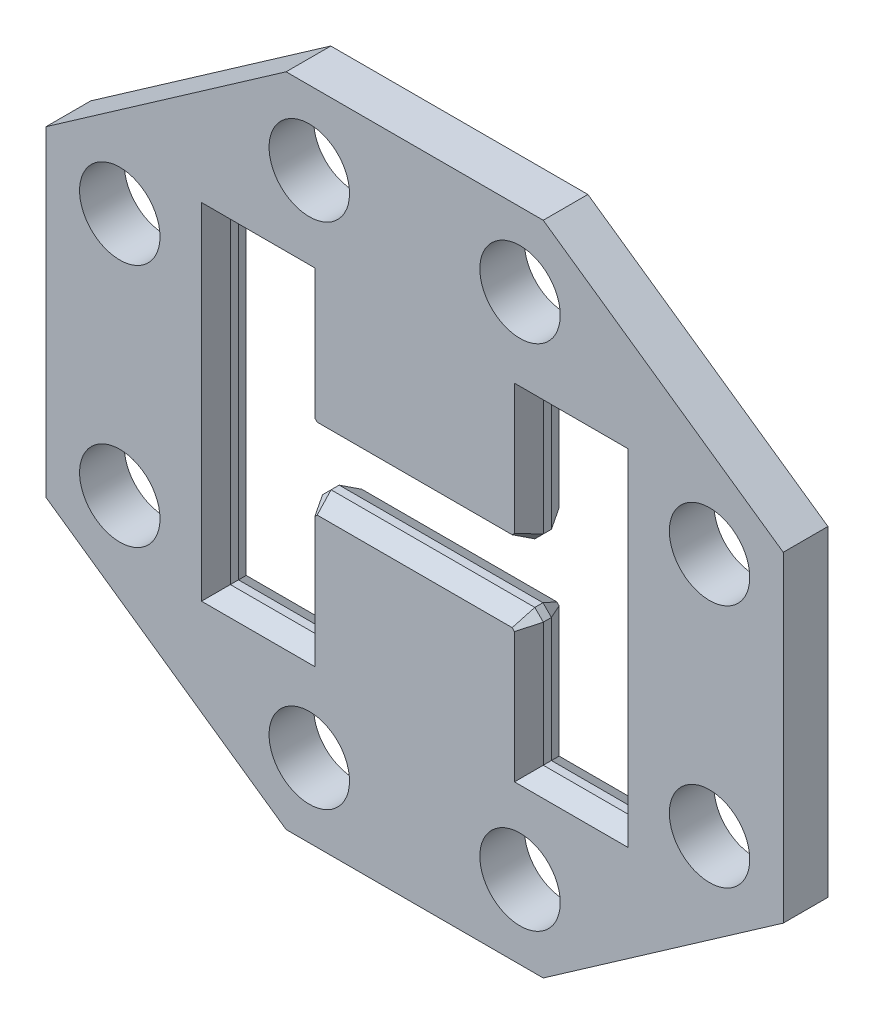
ISO-10303-21;
HEADER;
FILE_DESCRIPTION(('STEP AP214'),'2;1');
FILE_NAME('part.step','',(''),(''),'','','');
FILE_SCHEMA(('AUTOMOTIVE_DESIGN { 1 0 10303 214 1 1 1 1 }'));
ENDSEC;
DATA;
#1=APPLICATION_CONTEXT('core data for automotive mechanical design processes');
#2=APPLICATION_PROTOCOL_DEFINITION('international standard','automotive_design',2000,#1);
#3=PRODUCT_CONTEXT('',#1,'mechanical');
#4=PRODUCT('Part','Part','',(#3));
#5=PRODUCT_RELATED_PRODUCT_CATEGORY('part','',(#4));
#6=PRODUCT_DEFINITION_FORMATION('','',#4);
#7=PRODUCT_DEFINITION_CONTEXT('part definition',#1,'design');
#8=PRODUCT_DEFINITION('design','',#6,#7);
#9=PRODUCT_DEFINITION_SHAPE('','',#8);
#10=(LENGTH_UNIT() NAMED_UNIT(*) SI_UNIT(.MILLI.,.METRE.));
#11=(NAMED_UNIT(*) PLANE_ANGLE_UNIT() SI_UNIT($,.RADIAN.));
#12=(NAMED_UNIT(*) SI_UNIT($,.STERADIAN.) SOLID_ANGLE_UNIT());
#13=UNCERTAINTY_MEASURE_WITH_UNIT(LENGTH_MEASURE(1.E-05),#10,'distance_accuracy_value','');
#14=(GEOMETRIC_REPRESENTATION_CONTEXT(3) GLOBAL_UNCERTAINTY_ASSIGNED_CONTEXT((#13)) GLOBAL_UNIT_ASSIGNED_CONTEXT((#10,
#11,#12)) REPRESENTATION_CONTEXT('',''));
#15=CARTESIAN_POINT('',(0.,0.,0.));
#16=DIRECTION('',(0.,0.,1.));
#17=DIRECTION('',(1.,0.,0.));
#18=AXIS2_PLACEMENT_3D('',#15,#16,#17);
#19=CARTESIAN_POINT('',(-2.1316282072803E-11,2.8421709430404E-11,31.7499999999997));
#20=DIRECTION('',(0.,0.,-1.));
#21=DIRECTION('',(-1.,0.,0.));
#22=AXIS2_PLACEMENT_3D('',#19,#20,#21);
#23=PLANE('',#22);
#24=CARTESIAN_POINT('',(-149.758610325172,-361.549268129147,31.750000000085));
#25=DIRECTION('',(0.,0.,1.));
#26=DIRECTION('',(1.,0.,0.));
#27=AXIS2_PLACEMENT_3D('',#24,#25,#26);
#28=CIRCLE('',#27,57.15);
#29=CARTESIAN_POINT('',(-92.6086103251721,-361.549268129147,31.750000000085));
#30=VERTEX_POINT('',#29);
#31=EDGE_CURVE('E1285',#30,#30,#28,.T.);
#32=ORIENTED_EDGE('',*,*,#31,.F.);
#33=EDGE_LOOP('',(#32));
#34=FACE_BOUND('',#33,.T.);
#35=CARTESIAN_POINT('',(149.758610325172,-361.549268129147,31.7500000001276));
#36=DIRECTION('',(0.,0.,1.));
#37=DIRECTION('',(1.,0.,0.));
#38=AXIS2_PLACEMENT_3D('',#35,#36,#37);
#39=CIRCLE('',#38,57.15);
#40=CARTESIAN_POINT('',(206.908610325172,-361.549268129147,31.7500000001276));
#41=VERTEX_POINT('',#40);
#42=EDGE_CURVE('E1289',#41,#41,#39,.T.);
#43=ORIENTED_EDGE('',*,*,#42,.F.);
#44=EDGE_LOOP('',(#43));
#45=FACE_BOUND('',#44,.T.);
#46=CARTESIAN_POINT('',(419.080268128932,-173.588730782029,31.7500000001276));
#47=DIRECTION('',(0.,0.,1.));
#48=DIRECTION('',(1.,0.,0.));
#49=AXIS2_PLACEMENT_3D('',#46,#47,#48);
#50=CIRCLE('',#49,57.15);
#51=CARTESIAN_POINT('',(476.230268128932,-173.588730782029,31.7500000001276));
#52=VERTEX_POINT('',#51);
#53=EDGE_CURVE('E1504',#52,#52,#50,.T.);
#54=ORIENTED_EDGE('',*,*,#53,.F.);
#55=EDGE_LOOP('',(#54));
#56=FACE_BOUND('',#55,.T.);
#57=CARTESIAN_POINT('',(419.080268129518,173.588730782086,31.7499999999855));
#58=DIRECTION('',(0.,0.,1.));
#59=DIRECTION('',(1.,0.,0.));
#60=AXIS2_PLACEMENT_3D('',#57,#58,#59);
#61=CIRCLE('',#60,57.15);
#62=CARTESIAN_POINT('',(476.230268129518,173.588730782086,31.7499999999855));
#63=VERTEX_POINT('',#62);
#64=EDGE_CURVE('E1495',#63,#63,#61,.T.);
#65=ORIENTED_EDGE('',*,*,#64,.F.);
#66=EDGE_LOOP('',(#65));
#67=FACE_BOUND('',#66,.T.);
#68=CARTESIAN_POINT('',(149.758610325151,361.549268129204,31.7500000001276));
#69=DIRECTION('',(0.,0.,1.));
#70=DIRECTION('',(1.,0.,0.));
#71=AXIS2_PLACEMENT_3D('',#68,#69,#70);
#72=CIRCLE('',#71,57.15);
#73=CARTESIAN_POINT('',(206.908610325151,361.549268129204,31.7500000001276));
#74=VERTEX_POINT('',#73);
#75=EDGE_CURVE('E1482',#74,#74,#72,.T.);
#76=ORIENTED_EDGE('',*,*,#75,.F.);
#77=EDGE_LOOP('',(#76));
#78=FACE_BOUND('',#77,.T.);
#79=CARTESIAN_POINT('',(-149.758610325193,361.549268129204,31.750000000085));
#80=DIRECTION('',(0.,0.,1.));
#81=DIRECTION('',(1.,0.,0.));
#82=AXIS2_PLACEMENT_3D('',#79,#80,#81);
#83=CIRCLE('',#82,57.15);
#84=CARTESIAN_POINT('',(-92.6086103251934,361.549268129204,31.750000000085));
#85=VERTEX_POINT('',#84);
#86=EDGE_CURVE('E1473',#85,#85,#83,.T.);
#87=ORIENTED_EDGE('',*,*,#86,.F.);
#88=EDGE_LOOP('',(#87));
#89=FACE_BOUND('',#88,.T.);
#90=CARTESIAN_POINT('',(-419.080268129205,173.588730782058,31.7499999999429));
#91=DIRECTION('',(0.,0.,1.));
#92=DIRECTION('',(1.,0.,0.));
#93=AXIS2_PLACEMENT_3D('',#90,#91,#92);
#94=CIRCLE('',#93,57.15);
#95=CARTESIAN_POINT('',(-361.930268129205,173.588730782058,31.7499999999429));
#96=VERTEX_POINT('',#95);
#97=EDGE_CURVE('E1298',#96,#96,#94,.T.);
#98=ORIENTED_EDGE('',*,*,#97,.F.);
#99=EDGE_LOOP('',(#98));
#100=FACE_BOUND('',#99,.T.);
#101=CARTESIAN_POINT('',(-419.080268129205,-173.588730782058,31.750000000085));
#102=DIRECTION('',(0.,0.,1.));
#103=DIRECTION('',(1.,0.,0.));
#104=AXIS2_PLACEMENT_3D('',#101,#102,#103);
#105=CIRCLE('',#104,57.15);
#106=CARTESIAN_POINT('',(-361.930268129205,-173.588730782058,31.750000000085));
#107=VERTEX_POINT('',#106);
#108=EDGE_CURVE('E1293',#107,#107,#105,.T.);
#109=ORIENTED_EDGE('',*,*,#108,.F.);
#110=EDGE_LOOP('',(#109));
#111=FACE_BOUND('',#110,.T.);
#112=DIRECTION('',(-1.,0.,0.));
#113=VECTOR('',#112,1.);
#114=CARTESIAN_POINT('',(156.845000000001,-245.377999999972,31.7499999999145));
#115=LINE('',#114,#113);
#116=CARTESIAN_POINT('',(302.908999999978,-245.377999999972,31.7500000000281));
#117=VERTEX_POINT('',#116);
#118=CARTESIAN_POINT('',(141.845,-245.377999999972,31.7499999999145));
#119=VERTEX_POINT('',#118);
#120=EDGE_CURVE('E386',#117,#119,#115,.T.);
#121=ORIENTED_EDGE('',*,*,#120,.T.);
#122=DIRECTION('',(0.,1.,0.));
#123=VECTOR('',#122,1.);
#124=CARTESIAN_POINT('',(141.844999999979,-54.228999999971,31.7499999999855));
#125=LINE('',#124,#123);
#126=CARTESIAN_POINT('',(141.844999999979,-60.4422034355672,31.7499999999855));
#127=VERTEX_POINT('',#126);
#128=EDGE_CURVE('E387',#119,#127,#125,.T.);
#129=ORIENTED_EDGE('',*,*,#128,.T.);
#130=DIRECTION('',(-0.707106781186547,0.707106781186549,0.));
#131=VECTOR('',#130,1.);
#132=CARTESIAN_POINT('',(134.173398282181,-52.7706017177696,31.7499999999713));
#133=LINE('',#132,#131);
#134=CARTESIAN_POINT('',(138.566796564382,-57.1639999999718,31.7499999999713));
#135=VERTEX_POINT('',#134);
#136=EDGE_CURVE('E338',#127,#135,#133,.T.);
#137=ORIENTED_EDGE('',*,*,#136,.T.);
#138=DIRECTION('',(-1.,0.,0.));
#139=VECTOR('',#138,1.);
#140=CARTESIAN_POINT('',(-144.780000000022,-57.1639999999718,31.7499999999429));
#141=LINE('',#140,#139);
#142=CARTESIAN_POINT('',(-138.566796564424,-57.1639999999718,31.7499999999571));
#143=VERTEX_POINT('',#142);
#144=EDGE_CURVE('E350',#135,#143,#141,.T.);
#145=ORIENTED_EDGE('',*,*,#144,.T.);
#146=DIRECTION('',(-0.707106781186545,-0.70710678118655,0.));
#147=VECTOR('',#146,1.);
#148=CARTESIAN_POINT('',(-146.238398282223,-64.8356017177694,31.7499999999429));
#149=LINE('',#148,#147);
#150=CARTESIAN_POINT('',(-141.845000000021,-60.4422034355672,31.7499999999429));
#151=VERTEX_POINT('',#150);
#152=EDGE_CURVE('E351',#143,#151,#149,.T.);
#153=ORIENTED_EDGE('',*,*,#152,.T.);
#154=DIRECTION('',(0.,-1.,0.));
#155=VECTOR('',#154,1.);
#156=CARTESIAN_POINT('',(-141.845,-230.377999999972,31.750000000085));
#157=LINE('',#156,#155);
#158=CARTESIAN_POINT('',(-141.845,-245.377999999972,31.750000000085));
#159=VERTEX_POINT('',#158);
#160=EDGE_CURVE('E353',#151,#159,#157,.T.);
#161=ORIENTED_EDGE('',*,*,#160,.T.);
#162=DIRECTION('',(-1.,0.,0.));
#163=VECTOR('',#162,1.);
#164=CARTESIAN_POINT('',(-287.909000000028,-245.377999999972,31.7499999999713));
#165=LINE('',#164,#163);
#166=CARTESIAN_POINT('',(-302.909000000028,-245.377999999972,31.7499999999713));
#167=VERTEX_POINT('',#166);
#168=EDGE_CURVE('E357',#159,#167,#165,.T.);
#169=ORIENTED_EDGE('',*,*,#168,.T.);
#170=DIRECTION('',(0.,1.,0.));
#171=VECTOR('',#170,1.);
#172=CARTESIAN_POINT('',(-302.909000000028,230.378000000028,31.7500000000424));
#173=LINE('',#172,#171);
#174=CARTESIAN_POINT('',(-302.909000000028,245.378000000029,31.7499999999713));
#175=VERTEX_POINT('',#174);
#176=EDGE_CURVE('E359',#167,#175,#173,.T.);
#177=ORIENTED_EDGE('',*,*,#176,.T.);
#178=DIRECTION('',(1.,0.,0.));
#179=VECTOR('',#178,1.);
#180=CARTESIAN_POINT('',(-156.845000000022,245.378000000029,31.750000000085));
#181=LINE('',#180,#179);
#182=CARTESIAN_POINT('',(-141.845000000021,245.378000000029,31.750000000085));
#183=VERTEX_POINT('',#182);
#184=EDGE_CURVE('E361',#175,#183,#181,.T.);
#185=ORIENTED_EDGE('',*,*,#184,.T.);
#186=DIRECTION('',(0.,-1.,0.));
#187=VECTOR('',#186,1.);
#188=CARTESIAN_POINT('',(-141.845000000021,54.2290000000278,31.750000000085));
#189=LINE('',#188,#187);
#190=CARTESIAN_POINT('',(-141.845000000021,60.4422034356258,31.750000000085));
#191=VERTEX_POINT('',#190);
#192=EDGE_CURVE('E366',#183,#191,#189,.T.);
#193=ORIENTED_EDGE('',*,*,#192,.T.);
#194=DIRECTION('',(0.707106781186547,-0.707106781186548,0.));
#195=VECTOR('',#194,1.);
#196=CARTESIAN_POINT('',(-134.173398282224,52.7706017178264,31.7500000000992));
#197=LINE('',#196,#195);
#198=CARTESIAN_POINT('',(-138.566796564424,57.1640000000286,31.7500000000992));
#199=VERTEX_POINT('',#198);
#200=EDGE_CURVE('E367',#191,#199,#197,.T.);
#201=ORIENTED_EDGE('',*,*,#200,.T.);
#202=DIRECTION('',(1.,0.,0.));
#203=VECTOR('',#202,1.);
#204=CARTESIAN_POINT('',(144.779999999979,57.1640000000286,31.7500000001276));
#205=LINE('',#204,#203);
#206=CARTESIAN_POINT('',(138.566796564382,57.1640000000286,31.7500000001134));
#207=VERTEX_POINT('',#206);
#208=EDGE_CURVE('E375',#199,#207,#205,.T.);
#209=ORIENTED_EDGE('',*,*,#208,.T.);
#210=DIRECTION('',(0.707106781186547,0.707106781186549,0.));
#211=VECTOR('',#210,1.);
#212=CARTESIAN_POINT('',(146.238398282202,64.8356017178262,31.7500000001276));
#213=LINE('',#212,#211);
#214=CARTESIAN_POINT('',(141.844999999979,60.4422034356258,31.7500000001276));
#215=VERTEX_POINT('',#214);
#216=EDGE_CURVE('E374',#207,#215,#213,.T.);
#217=ORIENTED_EDGE('',*,*,#216,.T.);
#218=DIRECTION('',(0.,1.,0.));
#219=VECTOR('',#218,1.);
#220=CARTESIAN_POINT('',(141.844999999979,230.378000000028,31.7499999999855));
#221=LINE('',#220,#219);
#222=CARTESIAN_POINT('',(141.844999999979,245.378000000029,31.7499999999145));
#223=VERTEX_POINT('',#222);
#224=EDGE_CURVE('E377',#215,#223,#221,.T.);
#225=ORIENTED_EDGE('',*,*,#224,.T.);
#226=DIRECTION('',(1.,0.,0.));
#227=VECTOR('',#226,1.);
#228=CARTESIAN_POINT('',(287.908999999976,245.378000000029,31.7500000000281));
#229=LINE('',#228,#227);
#230=CARTESIAN_POINT('',(302.908999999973,245.378000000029,31.7500000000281));
#231=VERTEX_POINT('',#230);
#232=EDGE_CURVE('E382',#223,#231,#229,.T.);
#233=ORIENTED_EDGE('',*,*,#232,.T.);
#234=DIRECTION('',(0.,-1.,0.));
#235=VECTOR('',#234,1.);
#236=CARTESIAN_POINT('',(302.908999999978,-230.377999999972,31.7500000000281));
#237=LINE('',#236,#235);
#238=EDGE_CURVE('E381',#231,#117,#237,.T.);
#239=ORIENTED_EDGE('',*,*,#238,.T.);
#240=EDGE_LOOP('',(#121,#129,#137,#145,#153,#161,#169,#177,#185,#193,#201,#209,#217,#225,#233,#239));
#241=FACE_BOUND('',#240,.T.);
#242=DIRECTION('',(0.,-1.,0.));
#243=VECTOR('',#242,1.);
#244=CARTESIAN_POINT('',(-523.855268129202,-228.234235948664,31.7499999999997));
#245=LINE('',#244,#243);
#246=CARTESIAN_POINT('',(-523.855268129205,228.234235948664,31.7500000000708));
#247=VERTEX_POINT('',#246);
#248=CARTESIAN_POINT('',(-523.855268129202,-228.234235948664,31.7499999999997));
#249=VERTEX_POINT('',#248);
#250=EDGE_CURVE('E316',#247,#249,#245,.T.);
#251=ORIENTED_EDGE('',*,*,#250,.T.);
#252=DIRECTION('',(0.820038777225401,-0.572307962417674,0.));
#253=VECTOR('',#252,1.);
#254=CARTESIAN_POINT('',(-182.704923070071,-466.324268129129,31.7500000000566));
#255=LINE('',#254,#253);
#256=CARTESIAN_POINT('',(-182.704923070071,-466.324268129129,31.7500000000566));
#257=VERTEX_POINT('',#256);
#258=EDGE_CURVE('E310',#249,#257,#255,.T.);
#259=ORIENTED_EDGE('',*,*,#258,.T.);
#260=DIRECTION('',(1.,0.,0.));
#261=VECTOR('',#260,1.);
#262=CARTESIAN_POINT('',(182.704923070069,-466.32426812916,31.7499999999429));
#263=LINE('',#262,#261);
#264=CARTESIAN_POINT('',(182.704923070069,-466.32426812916,31.7499999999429));
#265=VERTEX_POINT('',#264);
#266=EDGE_CURVE('E319',#257,#265,#263,.T.);
#267=ORIENTED_EDGE('',*,*,#266,.T.);
#268=DIRECTION('',(0.820038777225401,0.572307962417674,0.));
#269=VECTOR('',#268,1.);
#270=CARTESIAN_POINT('',(523.855268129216,-228.234235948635,31.7499999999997));
#271=LINE('',#270,#269);
#272=CARTESIAN_POINT('',(523.855268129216,-228.234235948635,31.7499999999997));
#273=VERTEX_POINT('',#272);
#274=EDGE_CURVE('E708',#265,#273,#271,.T.);
#275=ORIENTED_EDGE('',*,*,#274,.T.);
#276=DIRECTION('',(0.,1.,0.));
#277=VECTOR('',#276,1.);
#278=CARTESIAN_POINT('',(523.855268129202,228.234235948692,31.7500000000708));
#279=LINE('',#278,#277);
#280=CARTESIAN_POINT('',(523.855268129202,228.234235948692,31.7500000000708));
#281=VERTEX_POINT('',#280);
#282=EDGE_CURVE('E715',#273,#281,#279,.T.);
#283=ORIENTED_EDGE('',*,*,#282,.T.);
#284=DIRECTION('',(-0.820038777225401,0.572307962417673,0.));
#285=VECTOR('',#284,1.);
#286=CARTESIAN_POINT('',(182.704923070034,466.324268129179,31.7500000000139));
#287=LINE('',#286,#285);
#288=CARTESIAN_POINT('',(182.704923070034,466.324268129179,31.7500000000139));
#289=VERTEX_POINT('',#288);
#290=EDGE_CURVE('E719',#281,#289,#287,.T.);
#291=ORIENTED_EDGE('',*,*,#290,.T.);
#292=DIRECTION('',(-1.,0.,0.));
#293=VECTOR('',#292,1.);
#294=CARTESIAN_POINT('',(-182.704923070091,466.324268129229,31.7500000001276));
#295=LINE('',#294,#293);
#296=CARTESIAN_POINT('',(-182.704923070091,466.324268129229,31.7500000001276));
#297=VERTEX_POINT('',#296);
#298=EDGE_CURVE('E718',#289,#297,#295,.T.);
#299=ORIENTED_EDGE('',*,*,#298,.T.);
#300=DIRECTION('',(-0.8200387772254,-0.572307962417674,0.));
#301=VECTOR('',#300,1.);
#302=CARTESIAN_POINT('',(-523.855268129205,228.234235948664,31.7500000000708));
#303=LINE('',#302,#301);
#304=EDGE_CURVE('E325',#297,#247,#303,.T.);
#305=ORIENTED_EDGE('',*,*,#304,.T.);
#306=EDGE_LOOP('',(#251,#259,#267,#275,#283,#291,#299,#305));
#307=FACE_BOUND('',#306,.T.);
#308=ADVANCED_FACE('F44',(#34,#45,#56,#67,#78,#89,#100,#111,#241,#307),#23,.F.);
#309=CARTESIAN_POINT('',(0.,-2.8421709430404E-11,-31.7499999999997));
#310=DIRECTION('',(0.,0.,-1.));
#311=DIRECTION('',(-1.,0.,0.));
#312=AXIS2_PLACEMENT_3D('',#309,#310,#311);
#313=PLANE('',#312);
#314=CARTESIAN_POINT('',(-149.758610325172,-361.549268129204,-31.7499999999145));
#315=DIRECTION('',(0.,0.,1.));
#316=DIRECTION('',(1.,0.,0.));
#317=AXIS2_PLACEMENT_3D('',#314,#315,#316);
#318=CIRCLE('',#317,57.15);
#319=CARTESIAN_POINT('',(-92.6086103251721,-361.549268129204,-31.7499999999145));
#320=VERTEX_POINT('',#319);
#321=EDGE_CURVE('E1279',#320,#320,#318,.T.);
#322=ORIENTED_EDGE('',*,*,#321,.T.);
#323=EDGE_LOOP('',(#322));
#324=FACE_BOUND('',#323,.T.);
#325=CARTESIAN_POINT('',(149.758610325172,-361.549268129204,-31.7499999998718));
#326=DIRECTION('',(0.,0.,1.));
#327=DIRECTION('',(1.,0.,0.));
#328=AXIS2_PLACEMENT_3D('',#325,#326,#327);
#329=CIRCLE('',#328,57.15);
#330=CARTESIAN_POINT('',(206.908610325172,-361.549268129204,-31.7499999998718));
#331=VERTEX_POINT('',#330);
#332=EDGE_CURVE('E1282',#331,#331,#329,.T.);
#333=ORIENTED_EDGE('',*,*,#332,.T.);
#334=EDGE_LOOP('',(#333));
#335=FACE_BOUND('',#334,.T.);
#336=CARTESIAN_POINT('',(419.080268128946,-173.588730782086,-31.7499999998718));
#337=DIRECTION('',(0.,0.,1.));
#338=DIRECTION('',(1.,0.,0.));
#339=AXIS2_PLACEMENT_3D('',#336,#337,#338);
#340=CIRCLE('',#339,57.15);
#341=CARTESIAN_POINT('',(476.230268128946,-173.588730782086,-31.7499999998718));
#342=VERTEX_POINT('',#341);
#343=EDGE_CURVE('E1506',#342,#342,#340,.T.);
#344=ORIENTED_EDGE('',*,*,#343,.T.);
#345=EDGE_LOOP('',(#344));
#346=FACE_BOUND('',#345,.T.);
#347=CARTESIAN_POINT('',(419.080268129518,173.588730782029,-31.7500000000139));
#348=DIRECTION('',(0.,0.,1.));
#349=DIRECTION('',(1.,0.,0.));
#350=AXIS2_PLACEMENT_3D('',#347,#348,#349);
#351=CIRCLE('',#350,57.15);
#352=CARTESIAN_POINT('',(476.230268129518,173.588730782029,-31.7500000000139));
#353=VERTEX_POINT('',#352);
#354=EDGE_CURVE('E1500',#353,#353,#351,.T.);
#355=ORIENTED_EDGE('',*,*,#354,.T.);
#356=EDGE_LOOP('',(#355));
#357=FACE_BOUND('',#356,.T.);
#358=CARTESIAN_POINT('',(149.758610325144,361.549268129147,-31.7499999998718));
#359=DIRECTION('',(0.,0.,1.));
#360=DIRECTION('',(1.,0.,0.));
#361=AXIS2_PLACEMENT_3D('',#358,#359,#360);
#362=CIRCLE('',#361,57.15);
#363=CARTESIAN_POINT('',(206.908610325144,361.549268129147,-31.7499999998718));
#364=VERTEX_POINT('',#363);
#365=EDGE_CURVE('E1489',#364,#364,#362,.T.);
#366=ORIENTED_EDGE('',*,*,#365,.T.);
#367=EDGE_LOOP('',(#366));
#368=FACE_BOUND('',#367,.T.);
#369=CARTESIAN_POINT('',(-149.7586103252,361.549268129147,-31.7499999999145));
#370=DIRECTION('',(0.,0.,1.));
#371=DIRECTION('',(1.,0.,0.));
#372=AXIS2_PLACEMENT_3D('',#369,#370,#371);
#373=CIRCLE('',#372,57.15);
#374=CARTESIAN_POINT('',(-92.6086103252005,361.549268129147,-31.7499999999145));
#375=VERTEX_POINT('',#374);
#376=EDGE_CURVE('E1478',#375,#375,#373,.T.);
#377=ORIENTED_EDGE('',*,*,#376,.T.);
#378=EDGE_LOOP('',(#377));
#379=FACE_BOUND('',#378,.T.);
#380=CARTESIAN_POINT('',(-419.080268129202,173.588730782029,-31.7500000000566));
#381=DIRECTION('',(0.,0.,1.));
#382=DIRECTION('',(1.,0.,0.));
#383=AXIS2_PLACEMENT_3D('',#380,#381,#382);
#384=CIRCLE('',#383,57.15);
#385=CARTESIAN_POINT('',(-361.930268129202,173.588730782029,-31.7500000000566));
#386=VERTEX_POINT('',#385);
#387=EDGE_CURVE('E1466',#386,#386,#384,.T.);
#388=ORIENTED_EDGE('',*,*,#387,.T.);
#389=EDGE_LOOP('',(#388));
#390=FACE_BOUND('',#389,.T.);
#391=CARTESIAN_POINT('',(-419.080268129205,-173.588730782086,-31.7499999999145));
#392=DIRECTION('',(0.,0.,1.));
#393=DIRECTION('',(1.,0.,0.));
#394=AXIS2_PLACEMENT_3D('',#391,#392,#393);
#395=CIRCLE('',#394,57.15);
#396=CARTESIAN_POINT('',(-361.930268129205,-173.588730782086,-31.7499999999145));
#397=VERTEX_POINT('',#396);
#398=EDGE_CURVE('E599',#397,#397,#395,.T.);
#399=ORIENTED_EDGE('',*,*,#398,.T.);
#400=EDGE_LOOP('',(#399));
#401=FACE_BOUND('',#400,.T.);
#402=DIRECTION('',(0.,1.,0.));
#403=VECTOR('',#402,1.);
#404=CARTESIAN_POINT('',(-141.845,-2.8421709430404E-11,-31.7499999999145));
#405=LINE('',#404,#403);
#406=CARTESIAN_POINT('',(-141.845,-245.378000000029,-31.7499999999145));
#407=VERTEX_POINT('',#406);
#408=CARTESIAN_POINT('',(-141.845,-60.442203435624,-31.7500000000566));
#409=VERTEX_POINT('',#408);
#410=EDGE_CURVE('E543',#407,#409,#405,.T.);
#411=ORIENTED_EDGE('',*,*,#410,.T.);
#412=DIRECTION('',(0.707106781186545,0.70710678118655,0.));
#413=VECTOR('',#412,1.);
#414=CARTESIAN_POINT('',(-40.7013982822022,40.7013982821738,-31.7500000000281));
#415=LINE('',#414,#413);
#416=CARTESIAN_POINT('',(-138.566796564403,-57.1640000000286,-31.7500000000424));
#417=VERTEX_POINT('',#416);
#418=EDGE_CURVE('E547',#409,#417,#415,.T.);
#419=ORIENTED_EDGE('',*,*,#418,.T.);
#420=DIRECTION('',(1.,0.,0.));
#421=VECTOR('',#420,1.);
#422=CARTESIAN_POINT('',(0.,-57.1640000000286,-31.7499999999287));
#423=LINE('',#422,#421);
#424=CARTESIAN_POINT('',(138.566796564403,-57.1640000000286,-31.7500000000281));
#425=VERTEX_POINT('',#424);
#426=EDGE_CURVE('E437',#417,#425,#423,.T.);
#427=ORIENTED_EDGE('',*,*,#426,.T.);
#428=DIRECTION('',(0.707106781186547,-0.707106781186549,0.));
#429=VECTOR('',#428,1.);
#430=CARTESIAN_POINT('',(40.7013982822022,40.7013982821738,-31.7499999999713));
#431=LINE('',#430,#429);
#432=CARTESIAN_POINT('',(141.845,-60.442203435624,-31.7500000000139));
#433=VERTEX_POINT('',#432);
#434=EDGE_CURVE('E504',#425,#433,#431,.T.);
#435=ORIENTED_EDGE('',*,*,#434,.T.);
#436=DIRECTION('',(0.,-1.,0.));
#437=VECTOR('',#436,1.);
#438=CARTESIAN_POINT('',(141.845,-2.8421709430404E-11,-31.750000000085));
#439=LINE('',#438,#437);
#440=CARTESIAN_POINT('',(141.845,-245.378000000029,-31.750000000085));
#441=VERTEX_POINT('',#440);
#442=EDGE_CURVE('E507',#433,#441,#439,.T.);
#443=ORIENTED_EDGE('',*,*,#442,.T.);
#444=DIRECTION('',(1.,0.,0.));
#445=VECTOR('',#444,1.);
#446=CARTESIAN_POINT('',(0.,-245.378000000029,-31.7499999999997));
#447=LINE('',#446,#445);
#448=CARTESIAN_POINT('',(302.908999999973,-245.378000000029,-31.7499999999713));
#449=VERTEX_POINT('',#448);
#450=EDGE_CURVE('E512',#441,#449,#447,.T.);
#451=ORIENTED_EDGE('',*,*,#450,.T.);
#452=DIRECTION('',(0.,1.,0.));
#453=VECTOR('',#452,1.);
#454=CARTESIAN_POINT('',(302.908999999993,-2.8421709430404E-11,-31.7499999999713));
#455=LINE('',#454,#453);
#456=CARTESIAN_POINT('',(302.908999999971,245.377999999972,-31.7499999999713));
#457=VERTEX_POINT('',#456);
#458=EDGE_CURVE('E511',#449,#457,#455,.T.);
#459=ORIENTED_EDGE('',*,*,#458,.T.);
#460=DIRECTION('',(-1.,0.,0.));
#461=VECTOR('',#460,1.);
#462=CARTESIAN_POINT('',(-2.8421709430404E-11,245.377999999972,-31.7499999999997));
#463=LINE('',#462,#461);
#464=CARTESIAN_POINT('',(141.844999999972,245.377999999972,-31.750000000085));
#465=VERTEX_POINT('',#464);
#466=EDGE_CURVE('E516',#457,#465,#463,.T.);
#467=ORIENTED_EDGE('',*,*,#466,.T.);
#468=DIRECTION('',(0.,-1.,0.));
#469=VECTOR('',#468,1.);
#470=CARTESIAN_POINT('',(141.845,-2.8421709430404E-11,-31.750000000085));
#471=LINE('',#470,#469);
#472=CARTESIAN_POINT('',(141.845,60.4422034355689,-31.7499999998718));
#473=VERTEX_POINT('',#472);
#474=EDGE_CURVE('E517',#465,#473,#471,.T.);
#475=ORIENTED_EDGE('',*,*,#474,.T.);
#476=DIRECTION('',(-0.707106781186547,-0.707106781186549,0.));
#477=VECTOR('',#476,1.);
#478=CARTESIAN_POINT('',(40.7013982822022,-40.7013982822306,-31.7499999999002));
#479=LINE('',#478,#477);
#480=CARTESIAN_POINT('',(138.566796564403,57.1639999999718,-31.749999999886));
#481=VERTEX_POINT('',#480);
#482=EDGE_CURVE('E525',#473,#481,#479,.T.);
#483=ORIENTED_EDGE('',*,*,#482,.T.);
#484=DIRECTION('',(-1.,0.,0.));
#485=VECTOR('',#484,1.);
#486=CARTESIAN_POINT('',(0.,57.1639999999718,-31.7499999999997));
#487=LINE('',#486,#485);
#488=CARTESIAN_POINT('',(-138.566796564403,57.1639999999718,-31.7499999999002));
#489=VERTEX_POINT('',#488);
#490=EDGE_CURVE('E526',#481,#489,#487,.T.);
#491=ORIENTED_EDGE('',*,*,#490,.T.);
#492=DIRECTION('',(-0.707106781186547,0.707106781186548,0.));
#493=VECTOR('',#492,1.);
#494=CARTESIAN_POINT('',(-40.7013982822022,-40.7013982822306,-31.7499999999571));
#495=LINE('',#494,#493);
#496=CARTESIAN_POINT('',(-141.845,60.4422034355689,-31.7499999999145));
#497=VERTEX_POINT('',#496);
#498=EDGE_CURVE('E528',#489,#497,#495,.T.);
#499=ORIENTED_EDGE('',*,*,#498,.T.);
#500=DIRECTION('',(0.,1.,0.));
#501=VECTOR('',#500,1.);
#502=CARTESIAN_POINT('',(-141.845,-2.8421709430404E-11,-31.7499999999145));
#503=LINE('',#502,#501);
#504=CARTESIAN_POINT('',(-141.845000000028,245.377999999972,-31.7499999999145));
#505=VERTEX_POINT('',#504);
#506=EDGE_CURVE('E535',#497,#505,#503,.T.);
#507=ORIENTED_EDGE('',*,*,#506,.T.);
#508=DIRECTION('',(-1.,0.,0.));
#509=VECTOR('',#508,1.);
#510=CARTESIAN_POINT('',(-2.8421709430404E-11,245.377999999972,-31.7499999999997));
#511=LINE('',#510,#509);
#512=CARTESIAN_POINT('',(-302.909000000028,245.377999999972,-31.7500000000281));
#513=VERTEX_POINT('',#512);
#514=EDGE_CURVE('E533',#505,#513,#511,.T.);
#515=ORIENTED_EDGE('',*,*,#514,.T.);
#516=DIRECTION('',(0.,-1.,0.));
#517=VECTOR('',#516,1.);
#518=CARTESIAN_POINT('',(-302.909000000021,-2.8421709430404E-11,-31.7500000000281));
#519=LINE('',#518,#517);
#520=CARTESIAN_POINT('',(-302.909000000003,-245.378000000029,-31.7500000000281));
#521=VERTEX_POINT('',#520);
#522=EDGE_CURVE('E540',#513,#521,#519,.T.);
#523=ORIENTED_EDGE('',*,*,#522,.T.);
#524=DIRECTION('',(1.,0.,0.));
#525=VECTOR('',#524,1.);
#526=CARTESIAN_POINT('',(0.,-245.378000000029,-31.7499999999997));
#527=LINE('',#526,#525);
#528=EDGE_CURVE('E544',#521,#407,#527,.T.);
#529=ORIENTED_EDGE('',*,*,#528,.T.);
#530=EDGE_LOOP('',(#411,#419,#427,#435,#443,#451,#459,#467,#475,#483,#491,#499,#507,#515,#523,#529));
#531=FACE_BOUND('',#530,.T.);
#532=DIRECTION('',(0.,-1.,0.));
#533=VECTOR('',#532,1.);
#534=CARTESIAN_POINT('',(-523.855268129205,-228.234235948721,-31.7499999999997));
#535=LINE('',#534,#533);
#536=CARTESIAN_POINT('',(-523.855268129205,228.234235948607,-31.7499999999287));
#537=VERTEX_POINT('',#536);
#538=CARTESIAN_POINT('',(-523.855268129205,-228.234235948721,-31.7499999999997));
#539=VERTEX_POINT('',#538);
#540=EDGE_CURVE('E332',#537,#539,#535,.T.);
#541=ORIENTED_EDGE('',*,*,#540,.F.);
#542=DIRECTION('',(-0.8200387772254,-0.572307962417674,0.));
#543=VECTOR('',#542,1.);
#544=CARTESIAN_POINT('',(-523.855268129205,228.234235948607,-31.7499999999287));
#545=LINE('',#544,#543);
#546=CARTESIAN_POINT('',(-182.704923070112,466.324268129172,-31.7499999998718));
#547=VERTEX_POINT('',#546);
#548=EDGE_CURVE('E330',#547,#537,#545,.T.);
#549=ORIENTED_EDGE('',*,*,#548,.F.);
#550=DIRECTION('',(-1.,0.,0.));
#551=VECTOR('',#550,1.);
#552=CARTESIAN_POINT('',(-182.704923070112,466.324268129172,-31.7499999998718));
#553=LINE('',#552,#551);
#554=CARTESIAN_POINT('',(182.704923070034,466.324268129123,-31.7499999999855));
#555=VERTEX_POINT('',#554);
#556=EDGE_CURVE('E742',#555,#547,#553,.T.);
#557=ORIENTED_EDGE('',*,*,#556,.F.);
#558=DIRECTION('',(-0.820038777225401,0.572307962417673,0.));
#559=VECTOR('',#558,1.);
#560=CARTESIAN_POINT('',(182.704923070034,466.324268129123,-31.7499999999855));
#561=LINE('',#560,#559);
#562=CARTESIAN_POINT('',(523.85526812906,228.234235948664,-31.7499999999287));
#563=VERTEX_POINT('',#562);
#564=EDGE_CURVE('E738',#563,#555,#561,.T.);
#565=ORIENTED_EDGE('',*,*,#564,.F.);
#566=DIRECTION('',(0.,1.,0.));
#567=VECTOR('',#566,1.);
#568=CARTESIAN_POINT('',(523.85526812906,228.234235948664,-31.7499999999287));
#569=LINE('',#568,#567);
#570=CARTESIAN_POINT('',(523.855268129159,-228.234235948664,-31.7499999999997));
#571=VERTEX_POINT('',#570);
#572=EDGE_CURVE('E739',#571,#563,#569,.T.);
#573=ORIENTED_EDGE('',*,*,#572,.F.);
#574=DIRECTION('',(0.820038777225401,0.572307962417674,0.));
#575=VECTOR('',#574,1.);
#576=CARTESIAN_POINT('',(523.855268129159,-228.234235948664,-31.7499999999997));
#577=LINE('',#576,#575);
#578=CARTESIAN_POINT('',(182.704923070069,-466.324268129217,-31.7500000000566));
#579=VERTEX_POINT('',#578);
#580=EDGE_CURVE('E735',#579,#571,#577,.T.);
#581=ORIENTED_EDGE('',*,*,#580,.F.);
#582=DIRECTION('',(1.,0.,0.));
#583=VECTOR('',#582,1.);
#584=CARTESIAN_POINT('',(182.704923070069,-466.324268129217,-31.7500000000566));
#585=LINE('',#584,#583);
#586=CARTESIAN_POINT('',(-182.704923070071,-466.324268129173,-31.7499999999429));
#587=VERTEX_POINT('',#586);
#588=EDGE_CURVE('E728',#587,#579,#585,.T.);
#589=ORIENTED_EDGE('',*,*,#588,.F.);
#590=DIRECTION('',(0.820038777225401,-0.572307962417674,0.));
#591=VECTOR('',#590,1.);
#592=CARTESIAN_POINT('',(-182.704923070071,-466.324268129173,-31.7499999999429));
#593=LINE('',#592,#591);
#594=EDGE_CURVE('E730',#539,#587,#593,.T.);
#595=ORIENTED_EDGE('',*,*,#594,.F.);
#596=EDGE_LOOP('',(#541,#549,#557,#565,#573,#581,#589,#595));
#597=FACE_BOUND('',#596,.T.);
#598=ADVANCED_FACE('F776',(#324,#335,#346,#357,#368,#379,#390,#401,#531,#597),#313,.T.);
#599=CARTESIAN_POINT('',(-523.855268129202,-228.234235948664,31.7499999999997));
#600=DIRECTION('',(1.,0.,0.));
#601=DIRECTION('',(0.,0.,-1.));
#602=AXIS2_PLACEMENT_3D('',#599,#600,#601);
#603=PLANE('',#602);
#604=ORIENTED_EDGE('',*,*,#540,.T.);
#605=DIRECTION('',(0.,0.,-1.));
#606=VECTOR('',#605,1.);
#607=CARTESIAN_POINT('',(-523.855268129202,-228.234235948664,31.7499999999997));
#608=LINE('',#607,#606);
#609=EDGE_CURVE('E311',#249,#539,#608,.T.);
#610=ORIENTED_EDGE('',*,*,#609,.F.);
#611=ORIENTED_EDGE('',*,*,#250,.F.);
#612=DIRECTION('',(0.,0.,-1.));
#613=VECTOR('',#612,1.);
#614=CARTESIAN_POINT('',(-523.855268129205,228.234235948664,31.7500000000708));
#615=LINE('',#614,#613);
#616=EDGE_CURVE('E723',#247,#537,#615,.T.);
#617=ORIENTED_EDGE('',*,*,#616,.T.);
#618=EDGE_LOOP('',(#604,#610,#611,#617));
#619=FACE_BOUND('',#618,.T.);
#620=ADVANCED_FACE('F327',(#619),#603,.F.);
#621=CARTESIAN_POINT('',(-182.704923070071,-466.324268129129,31.7500000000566));
#622=DIRECTION('',(0.572307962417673,0.820038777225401,0.));
#623=DIRECTION('',(-0.820038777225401,0.572307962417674,0.));
#624=AXIS2_PLACEMENT_3D('',#621,#622,#623);
#625=PLANE('',#624);
#626=ORIENTED_EDGE('',*,*,#594,.T.);
#627=DIRECTION('',(0.,0.,-1.));
#628=VECTOR('',#627,1.);
#629=CARTESIAN_POINT('',(-182.704923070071,-466.324268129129,31.7500000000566));
#630=LINE('',#629,#628);
#631=EDGE_CURVE('E313',#257,#587,#630,.T.);
#632=ORIENTED_EDGE('',*,*,#631,.F.);
#633=ORIENTED_EDGE('',*,*,#258,.F.);
#634=ORIENTED_EDGE('',*,*,#609,.T.);
#635=EDGE_LOOP('',(#626,#632,#633,#634));
#636=FACE_BOUND('',#635,.T.);
#637=ADVANCED_FACE('F307',(#636),#625,.F.);
#638=CARTESIAN_POINT('',(182.704923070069,-466.32426812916,31.7499999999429));
#639=DIRECTION('',(0.,1.,0.));
#640=DIRECTION('',(0.,0.,1.));
#641=AXIS2_PLACEMENT_3D('',#638,#639,#640);
#642=PLANE('',#641);
#643=ORIENTED_EDGE('',*,*,#588,.T.);
#644=DIRECTION('',(0.,0.,-1.));
#645=VECTOR('',#644,1.);
#646=CARTESIAN_POINT('',(182.704923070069,-466.32426812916,31.7499999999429));
#647=LINE('',#646,#645);
#648=EDGE_CURVE('E341',#265,#579,#647,.T.);
#649=ORIENTED_EDGE('',*,*,#648,.F.);
#650=ORIENTED_EDGE('',*,*,#266,.F.);
#651=ORIENTED_EDGE('',*,*,#631,.T.);
#652=EDGE_LOOP('',(#643,#649,#650,#651));
#653=FACE_BOUND('',#652,.T.);
#654=ADVANCED_FACE('F790',(#653),#642,.F.);
#655=CARTESIAN_POINT('',(523.855268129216,-228.234235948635,31.7499999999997));
#656=DIRECTION('',(-0.572307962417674,0.820038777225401,0.));
#657=DIRECTION('',(-0.820038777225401,-0.572307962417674,0.));
#658=AXIS2_PLACEMENT_3D('',#655,#656,#657);
#659=PLANE('',#658);
#660=ORIENTED_EDGE('',*,*,#580,.T.);
#661=DIRECTION('',(0.,0.,-1.));
#662=VECTOR('',#661,1.);
#663=CARTESIAN_POINT('',(523.855268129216,-228.234235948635,31.7499999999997));
#664=LINE('',#663,#662);
#665=EDGE_CURVE('E761',#273,#571,#664,.T.);
#666=ORIENTED_EDGE('',*,*,#665,.F.);
#667=ORIENTED_EDGE('',*,*,#274,.F.);
#668=ORIENTED_EDGE('',*,*,#648,.T.);
#669=EDGE_LOOP('',(#660,#666,#667,#668));
#670=FACE_BOUND('',#669,.T.);
#671=ADVANCED_FACE('F772',(#670),#659,.F.);
#672=CARTESIAN_POINT('',(523.855268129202,228.234235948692,31.7500000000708));
#673=DIRECTION('',(-1.,0.,0.));
#674=DIRECTION('',(0.,-1.,0.));
#675=AXIS2_PLACEMENT_3D('',#672,#673,#674);
#676=PLANE('',#675);
#677=ORIENTED_EDGE('',*,*,#572,.T.);
#678=DIRECTION('',(0.,0.,-1.));
#679=VECTOR('',#678,1.);
#680=CARTESIAN_POINT('',(523.855268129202,228.234235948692,31.7500000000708));
#681=LINE('',#680,#679);
#682=EDGE_CURVE('E760',#281,#563,#681,.T.);
#683=ORIENTED_EDGE('',*,*,#682,.F.);
#684=ORIENTED_EDGE('',*,*,#282,.F.);
#685=ORIENTED_EDGE('',*,*,#665,.T.);
#686=EDGE_LOOP('',(#677,#683,#684,#685));
#687=FACE_BOUND('',#686,.T.);
#688=ADVANCED_FACE('F781',(#687),#676,.F.);
#689=CARTESIAN_POINT('',(182.704923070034,466.324268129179,31.7500000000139));
#690=DIRECTION('',(-0.572307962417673,-0.820038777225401,0.));
#691=DIRECTION('',(0.820038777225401,-0.572307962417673,0.));
#692=AXIS2_PLACEMENT_3D('',#689,#690,#691);
#693=PLANE('',#692);
#694=ORIENTED_EDGE('',*,*,#564,.T.);
#695=DIRECTION('',(0.,0.,-1.));
#696=VECTOR('',#695,1.);
#697=CARTESIAN_POINT('',(182.704923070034,466.324268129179,31.7500000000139));
#698=LINE('',#697,#696);
#699=EDGE_CURVE('E751',#289,#555,#698,.T.);
#700=ORIENTED_EDGE('',*,*,#699,.F.);
#701=ORIENTED_EDGE('',*,*,#290,.F.);
#702=ORIENTED_EDGE('',*,*,#682,.T.);
#703=EDGE_LOOP('',(#694,#700,#701,#702));
#704=FACE_BOUND('',#703,.T.);
#705=ADVANCED_FACE('F786',(#704),#693,.F.);
#706=CARTESIAN_POINT('',(-182.704923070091,466.324268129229,31.7500000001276));
#707=DIRECTION('',(0.,-1.,0.));
#708=DIRECTION('',(1.,0.,0.));
#709=AXIS2_PLACEMENT_3D('',#706,#707,#708);
#710=PLANE('',#709);
#711=ORIENTED_EDGE('',*,*,#556,.T.);
#712=DIRECTION('',(0.,0.,-1.));
#713=VECTOR('',#712,1.);
#714=CARTESIAN_POINT('',(-182.704923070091,466.324268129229,31.7500000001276));
#715=LINE('',#714,#713);
#716=EDGE_CURVE('E750',#297,#547,#715,.T.);
#717=ORIENTED_EDGE('',*,*,#716,.F.);
#718=ORIENTED_EDGE('',*,*,#298,.F.);
#719=ORIENTED_EDGE('',*,*,#699,.T.);
#720=EDGE_LOOP('',(#711,#717,#718,#719));
#721=FACE_BOUND('',#720,.T.);
#722=ADVANCED_FACE('F816',(#721),#710,.F.);
#723=CARTESIAN_POINT('',(-523.855268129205,228.234235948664,31.7500000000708));
#724=DIRECTION('',(0.572307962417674,-0.820038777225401,0.));
#725=DIRECTION('',(0.820038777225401,0.572307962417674,0.));
#726=AXIS2_PLACEMENT_3D('',#723,#724,#725);
#727=PLANE('',#726);
#728=ORIENTED_EDGE('',*,*,#548,.T.);
#729=ORIENTED_EDGE('',*,*,#616,.F.);
#730=ORIENTED_EDGE('',*,*,#304,.F.);
#731=ORIENTED_EDGE('',*,*,#716,.T.);
#732=EDGE_LOOP('',(#728,#729,#730,#731));
#733=FACE_BOUND('',#732,.T.);
#734=ADVANCED_FACE('F814',(#733),#727,.F.);
#735=CARTESIAN_POINT('',(156.844999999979,-54.228999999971,31.7499999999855));
#736=DIRECTION('',(0.707106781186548,0.707106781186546,0.));
#737=DIRECTION('',(-0.707106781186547,0.707106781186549,0.));
#738=AXIS2_PLACEMENT_3D('',#735,#736,#737);
#739=PLANE('',#738);
#740=DIRECTION('',(0.,0.,-1.));
#741=VECTOR('',#740,1.);
#742=CARTESIAN_POINT('',(156.844999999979,-54.228999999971,31.7499999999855));
#743=LINE('',#742,#741);
#744=CARTESIAN_POINT('',(156.845000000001,-54.228999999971,5.76923788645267));
#745=VERTEX_POINT('',#744);
#746=CARTESIAN_POINT('',(156.845000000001,-54.2289999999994,-5.76923788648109));
#747=VERTEX_POINT('',#746);
#748=EDGE_CURVE('E704',#745,#747,#743,.T.);
#749=ORIENTED_EDGE('',*,*,#748,.T.);
#750=DIRECTION('',(-0.707106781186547,0.707106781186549,0.));
#751=VECTOR('',#750,1.);
#752=CARTESIAN_POINT('',(156.845000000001,-54.2289999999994,-5.76923788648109));
#753=LINE('',#752,#751);
#754=CARTESIAN_POINT('',(144.780000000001,-42.1639999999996,-5.76923788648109));
#755=VERTEX_POINT('',#754);
#756=EDGE_CURVE('E57',#747,#755,#753,.T.);
#757=ORIENTED_EDGE('',*,*,#756,.T.);
#758=DIRECTION('',(0.,0.,-1.));
#759=VECTOR('',#758,1.);
#760=CARTESIAN_POINT('',(144.779999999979,-42.1639999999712,31.7499999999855));
#761=LINE('',#760,#759);
#762=CARTESIAN_POINT('',(144.780000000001,-42.1639999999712,5.76923788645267));
#763=VERTEX_POINT('',#762);
#764=EDGE_CURVE('E505',#763,#755,#761,.T.);
#765=ORIENTED_EDGE('',*,*,#764,.F.);
#766=DIRECTION('',(0.707106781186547,-0.707106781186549,0.));
#767=VECTOR('',#766,1.);
#768=CARTESIAN_POINT('',(156.845000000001,-54.228999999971,5.76923788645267));
#769=LINE('',#768,#767);
#770=EDGE_CURVE('E436',#763,#745,#769,.T.);
#771=ORIENTED_EDGE('',*,*,#770,.T.);
#772=EDGE_LOOP('',(#749,#757,#765,#771));
#773=FACE_BOUND('',#772,.T.);
#774=ADVANCED_FACE('F812',(#773),#739,.T.);
#775=CARTESIAN_POINT('',(156.845000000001,-230.377999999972,31.7499999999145));
#776=DIRECTION('',(1.,0.,0.));
#777=DIRECTION('',(0.,0.,-1.));
#778=AXIS2_PLACEMENT_3D('',#775,#776,#777);
#779=PLANE('',#778);
#780=DIRECTION('',(0.,0.,-1.));
#781=VECTOR('',#780,1.);
#782=CARTESIAN_POINT('',(156.845000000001,-230.377999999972,31.7499999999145));
#783=LINE('',#782,#781);
#784=CARTESIAN_POINT('',(156.845000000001,-230.377999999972,5.76923788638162));
#785=VERTEX_POINT('',#784);
#786=CARTESIAN_POINT('',(156.845000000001,-230.378,-5.76923788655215));
#787=VERTEX_POINT('',#786);
#788=EDGE_CURVE('E705',#785,#787,#783,.T.);
#789=ORIENTED_EDGE('',*,*,#788,.T.);
#790=DIRECTION('',(0.,1.,0.));
#791=VECTOR('',#790,1.);
#792=CARTESIAN_POINT('',(156.845000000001,-230.378,-5.76923788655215));
#793=LINE('',#792,#791);
#794=EDGE_CURVE('E71',#787,#747,#793,.T.);
#795=ORIENTED_EDGE('',*,*,#794,.T.);
#796=ORIENTED_EDGE('',*,*,#748,.F.);
#797=DIRECTION('',(0.,-1.,0.));
#798=VECTOR('',#797,1.);
#799=CARTESIAN_POINT('',(156.845000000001,-230.377999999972,5.76923788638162));
#800=LINE('',#799,#798);
#801=EDGE_CURVE('E333',#745,#785,#800,.T.);
#802=ORIENTED_EDGE('',*,*,#801,.T.);
#803=EDGE_LOOP('',(#789,#795,#796,#802));
#804=FACE_BOUND('',#803,.T.);
#805=ADVANCED_FACE('F847',(#804),#779,.T.);
#806=CARTESIAN_POINT('',(287.908999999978,-230.377999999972,31.7500000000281));
#807=DIRECTION('',(0.,1.,0.));
#808=DIRECTION('',(0.,0.,1.));
#809=AXIS2_PLACEMENT_3D('',#806,#807,#808);
#810=PLANE('',#809);
#811=DIRECTION('',(0.,0.,-1.));
#812=VECTOR('',#811,1.);
#813=CARTESIAN_POINT('',(287.908999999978,-230.377999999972,31.7500000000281));
#814=LINE('',#813,#812);
#815=CARTESIAN_POINT('',(287.908999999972,-230.377999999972,5.7692378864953));
#816=VERTEX_POINT('',#815);
#817=CARTESIAN_POINT('',(287.908999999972,-230.377999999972,-5.76923788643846));
#818=VERTEX_POINT('',#817);
#819=EDGE_CURVE('E698',#816,#818,#814,.T.);
#820=ORIENTED_EDGE('',*,*,#819,.T.);
#821=DIRECTION('',(-1.,0.,0.));
#822=VECTOR('',#821,1.);
#823=CARTESIAN_POINT('',(287.908999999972,-230.377999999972,-5.76923788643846));
#824=LINE('',#823,#822);
#825=EDGE_CURVE('E590',#818,#787,#824,.T.);
#826=ORIENTED_EDGE('',*,*,#825,.T.);
#827=ORIENTED_EDGE('',*,*,#788,.F.);
#828=DIRECTION('',(1.,0.,0.));
#829=VECTOR('',#828,1.);
#830=CARTESIAN_POINT('',(287.908999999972,-230.377999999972,5.7692378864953));
#831=LINE('',#830,#829);
#832=EDGE_CURVE('E393',#785,#816,#831,.T.);
#833=ORIENTED_EDGE('',*,*,#832,.T.);
#834=EDGE_LOOP('',(#820,#826,#827,#833));
#835=FACE_BOUND('',#834,.T.);
#836=ADVANCED_FACE('F857',(#835),#810,.T.);
#837=CARTESIAN_POINT('',(287.908999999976,230.378000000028,31.7500000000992));
#838=DIRECTION('',(-1.,0.,0.));
#839=DIRECTION('',(0.,0.,1.));
#840=AXIS2_PLACEMENT_3D('',#837,#838,#839);
#841=PLANE('',#840);
#842=DIRECTION('',(0.,0.,-1.));
#843=VECTOR('',#842,1.);
#844=CARTESIAN_POINT('',(287.908999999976,230.378000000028,31.7500000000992));
#845=LINE('',#844,#843);
#846=CARTESIAN_POINT('',(287.90899999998,230.378000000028,5.76923788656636));
#847=VERTEX_POINT('',#846);
#848=CARTESIAN_POINT('',(287.908999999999,230.378000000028,-5.76923788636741));
#849=VERTEX_POINT('',#848);
#850=EDGE_CURVE('E689',#847,#849,#845,.T.);
#851=ORIENTED_EDGE('',*,*,#850,.T.);
#852=DIRECTION('',(0.,-1.,0.));
#853=VECTOR('',#852,1.);
#854=CARTESIAN_POINT('',(287.908999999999,230.378000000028,-5.76923788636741));
#855=LINE('',#854,#853);
#856=EDGE_CURVE('E582',#849,#818,#855,.T.);
#857=ORIENTED_EDGE('',*,*,#856,.T.);
#858=ORIENTED_EDGE('',*,*,#819,.F.);
#859=DIRECTION('',(0.,1.,0.));
#860=VECTOR('',#859,1.);
#861=CARTESIAN_POINT('',(287.90899999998,230.378000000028,5.76923788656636));
#862=LINE('',#861,#860);
#863=EDGE_CURVE('E397',#816,#847,#862,.T.);
#864=ORIENTED_EDGE('',*,*,#863,.T.);
#865=EDGE_LOOP('',(#851,#857,#858,#864));
#866=FACE_BOUND('',#865,.T.);
#867=ADVANCED_FACE('F861',(#866),#841,.T.);
#868=CARTESIAN_POINT('',(156.844999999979,230.378000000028,31.7499999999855));
#869=DIRECTION('',(0.,-1.,0.));
#870=DIRECTION('',(0.,0.,-1.));
#871=AXIS2_PLACEMENT_3D('',#868,#869,#870);
#872=PLANE('',#871);
#873=DIRECTION('',(0.,0.,-1.));
#874=VECTOR('',#873,1.);
#875=CARTESIAN_POINT('',(156.844999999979,230.378000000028,31.7499999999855));
#876=LINE('',#875,#874);
#877=CARTESIAN_POINT('',(156.845000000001,230.378000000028,5.76923788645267));
#878=VERTEX_POINT('',#877);
#879=CARTESIAN_POINT('',(156.845000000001,230.378,-5.76923788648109));
#880=VERTEX_POINT('',#879);
#881=EDGE_CURVE('E685',#878,#880,#876,.T.);
#882=ORIENTED_EDGE('',*,*,#881,.T.);
#883=DIRECTION('',(1.,0.,0.));
#884=VECTOR('',#883,1.);
#885=CARTESIAN_POINT('',(156.845000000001,230.378,-5.76923788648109));
#886=LINE('',#885,#884);
#887=EDGE_CURVE('E581',#880,#849,#886,.T.);
#888=ORIENTED_EDGE('',*,*,#887,.T.);
#889=ORIENTED_EDGE('',*,*,#850,.F.);
#890=DIRECTION('',(-1.,0.,0.));
#891=VECTOR('',#890,1.);
#892=CARTESIAN_POINT('',(156.845000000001,230.378000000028,5.76923788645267));
#893=LINE('',#892,#891);
#894=EDGE_CURVE('E400',#847,#878,#893,.T.);
#895=ORIENTED_EDGE('',*,*,#894,.T.);
#896=EDGE_LOOP('',(#882,#888,#889,#895));
#897=FACE_BOUND('',#896,.T.);
#898=ADVANCED_FACE('F867',(#897),#872,.T.);
#899=CARTESIAN_POINT('',(156.844999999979,54.2290000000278,31.7500000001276));
#900=DIRECTION('',(1.,0.,0.));
#901=DIRECTION('',(0.,0.,-1.));
#902=AXIS2_PLACEMENT_3D('',#899,#900,#901);
#903=PLANE('',#902);
#904=DIRECTION('',(0.,0.,-1.));
#905=VECTOR('',#904,1.);
#906=CARTESIAN_POINT('',(156.844999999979,54.2290000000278,31.7500000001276));
#907=LINE('',#906,#905);
#908=CARTESIAN_POINT('',(156.845000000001,54.2290000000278,5.76923788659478));
#909=VERTEX_POINT('',#908);
#910=CARTESIAN_POINT('',(156.845000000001,54.2289999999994,-5.76923788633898));
#911=VERTEX_POINT('',#910);
#912=EDGE_CURVE('E673',#909,#911,#907,.T.);
#913=ORIENTED_EDGE('',*,*,#912,.T.);
#914=DIRECTION('',(0.,1.,0.));
#915=VECTOR('',#914,1.);
#916=CARTESIAN_POINT('',(156.845000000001,54.2289999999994,-5.76923788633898));
#917=LINE('',#916,#915);
#918=EDGE_CURVE('E576',#911,#880,#917,.T.);
#919=ORIENTED_EDGE('',*,*,#918,.T.);
#920=ORIENTED_EDGE('',*,*,#881,.F.);
#921=DIRECTION('',(0.,-1.,0.));
#922=VECTOR('',#921,1.);
#923=CARTESIAN_POINT('',(156.845000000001,54.2290000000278,5.76923788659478));
#924=LINE('',#923,#922);
#925=EDGE_CURVE('E401',#878,#909,#924,.T.);
#926=ORIENTED_EDGE('',*,*,#925,.T.);
#927=EDGE_LOOP('',(#913,#919,#920,#926));
#928=FACE_BOUND('',#927,.T.);
#929=ADVANCED_FACE('F678',(#928),#903,.T.);
#930=CARTESIAN_POINT('',(144.779999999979,42.1640000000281,31.7500000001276));
#931=DIRECTION('',(0.707106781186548,-0.707106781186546,0.));
#932=DIRECTION('',(0.707106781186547,0.707106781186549,0.));
#933=AXIS2_PLACEMENT_3D('',#930,#931,#932);
#934=PLANE('',#933);
#935=DIRECTION('',(0.,0.,-1.));
#936=VECTOR('',#935,1.);
#937=CARTESIAN_POINT('',(144.779999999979,42.1640000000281,31.7500000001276));
#938=LINE('',#937,#936);
#939=CARTESIAN_POINT('',(144.780000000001,42.1640000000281,5.76923788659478));
#940=VERTEX_POINT('',#939);
#941=CARTESIAN_POINT('',(144.780000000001,42.1639999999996,-5.76923788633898));
#942=VERTEX_POINT('',#941);
#943=EDGE_CURVE('E677',#940,#942,#938,.T.);
#944=ORIENTED_EDGE('',*,*,#943,.T.);
#945=DIRECTION('',(0.707106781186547,0.707106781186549,0.));
#946=VECTOR('',#945,1.);
#947=CARTESIAN_POINT('',(144.780000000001,42.1639999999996,-5.76923788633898));
#948=LINE('',#947,#946);
#949=EDGE_CURVE('E577',#942,#911,#948,.T.);
#950=ORIENTED_EDGE('',*,*,#949,.T.);
#951=ORIENTED_EDGE('',*,*,#912,.F.);
#952=DIRECTION('',(-0.707106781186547,-0.707106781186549,0.));
#953=VECTOR('',#952,1.);
#954=CARTESIAN_POINT('',(144.780000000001,42.1640000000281,5.76923788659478));
#955=LINE('',#954,#953);
#956=EDGE_CURVE('E409',#909,#940,#955,.T.);
#957=ORIENTED_EDGE('',*,*,#956,.T.);
#958=EDGE_LOOP('',(#944,#950,#951,#957));
#959=FACE_BOUND('',#958,.T.);
#960=ADVANCED_FACE('F675',(#959),#934,.T.);
#961=CARTESIAN_POINT('',(-144.780000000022,42.1640000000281,31.750000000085));
#962=DIRECTION('',(0.,-1.,0.));
#963=DIRECTION('',(0.,0.,-1.));
#964=AXIS2_PLACEMENT_3D('',#961,#962,#963);
#965=PLANE('',#964);
#966=DIRECTION('',(0.,0.,-1.));
#967=VECTOR('',#966,1.);
#968=CARTESIAN_POINT('',(-144.780000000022,42.1640000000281,31.750000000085));
#969=LINE('',#968,#967);
#970=CARTESIAN_POINT('',(-144.780000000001,42.1639999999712,5.76923788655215));
#971=VERTEX_POINT('',#970);
#972=CARTESIAN_POINT('',(-144.780000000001,42.1639999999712,-5.76923788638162));
#973=VERTEX_POINT('',#972);
#974=EDGE_CURVE('E691',#971,#973,#969,.T.);
#975=ORIENTED_EDGE('',*,*,#974,.T.);
#976=DIRECTION('',(1.,0.,0.));
#977=VECTOR('',#976,1.);
#978=CARTESIAN_POINT('',(-144.780000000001,42.1639999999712,-5.76923788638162));
#979=LINE('',#978,#977);
#980=EDGE_CURVE('E572',#973,#942,#979,.T.);
#981=ORIENTED_EDGE('',*,*,#980,.T.);
#982=ORIENTED_EDGE('',*,*,#943,.F.);
#983=DIRECTION('',(-1.,0.,0.));
#984=VECTOR('',#983,1.);
#985=CARTESIAN_POINT('',(-144.780000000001,42.1639999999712,5.76923788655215));
#986=LINE('',#985,#984);
#987=EDGE_CURVE('E408',#940,#971,#986,.T.);
#988=ORIENTED_EDGE('',*,*,#987,.T.);
#989=EDGE_LOOP('',(#975,#981,#982,#988));
#990=FACE_BOUND('',#989,.T.);
#991=ADVANCED_FACE('F891',(#990),#965,.T.);
#992=CARTESIAN_POINT('',(-144.780000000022,42.1640000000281,31.750000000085));
#993=DIRECTION('',(-0.707106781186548,-0.707106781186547,0.));
#994=DIRECTION('',(0.707106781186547,-0.707106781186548,0.));
#995=AXIS2_PLACEMENT_3D('',#992,#993,#994);
#996=PLANE('',#995);
#997=DIRECTION('',(0.,0.,-1.));
#998=VECTOR('',#997,1.);
#999=CARTESIAN_POINT('',(-156.845000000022,54.2290000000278,31.750000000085));
#1000=LINE('',#999,#998);
#1001=CARTESIAN_POINT('',(-156.845000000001,54.228999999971,5.76923788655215));
#1002=VERTEX_POINT('',#1001);
#1003=CARTESIAN_POINT('',(-156.845000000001,54.228999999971,-5.76923788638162));
#1004=VERTEX_POINT('',#1003);
#1005=EDGE_CURVE('E1328',#1002,#1004,#1000,.T.);
#1006=ORIENTED_EDGE('',*,*,#1005,.T.);
#1007=DIRECTION('',(0.707106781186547,-0.707106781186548,0.));
#1008=VECTOR('',#1007,1.);
#1009=CARTESIAN_POINT('',(-144.780000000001,42.1639999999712,-5.76923788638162));
#1010=LINE('',#1009,#1008);
#1011=EDGE_CURVE('E569',#1004,#973,#1010,.T.);
#1012=ORIENTED_EDGE('',*,*,#1011,.T.);
#1013=ORIENTED_EDGE('',*,*,#974,.F.);
#1014=DIRECTION('',(-0.707106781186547,0.707106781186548,0.));
#1015=VECTOR('',#1014,1.);
#1016=CARTESIAN_POINT('',(-156.845000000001,54.228999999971,5.76923788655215));
#1017=LINE('',#1016,#1015);
#1018=EDGE_CURVE('E411',#971,#1002,#1017,.T.);
#1019=ORIENTED_EDGE('',*,*,#1018,.T.);
#1020=EDGE_LOOP('',(#1006,#1012,#1013,#1019));
#1021=FACE_BOUND('',#1020,.T.);
#1022=ADVANCED_FACE('F897',(#1021),#996,.T.);
#1023=CARTESIAN_POINT('',(-156.845000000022,230.378000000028,31.750000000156));
#1024=DIRECTION('',(-1.,0.,0.));
#1025=DIRECTION('',(0.,0.,1.));
#1026=AXIS2_PLACEMENT_3D('',#1023,#1024,#1025);
#1027=PLANE('',#1026);
#1028=DIRECTION('',(0.,0.,-1.));
#1029=VECTOR('',#1028,1.);
#1030=CARTESIAN_POINT('',(-156.845000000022,230.378000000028,31.750000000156));
#1031=LINE('',#1030,#1029);
#1032=CARTESIAN_POINT('',(-156.845000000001,230.377999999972,5.7692378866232));
#1033=VERTEX_POINT('',#1032);
#1034=CARTESIAN_POINT('',(-156.845000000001,230.377999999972,-5.76923788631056));
#1035=VERTEX_POINT('',#1034);
#1036=EDGE_CURVE('E1322',#1033,#1035,#1031,.T.);
#1037=ORIENTED_EDGE('',*,*,#1036,.T.);
#1038=DIRECTION('',(0.,-1.,0.));
#1039=VECTOR('',#1038,1.);
#1040=CARTESIAN_POINT('',(-156.845000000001,230.377999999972,-5.76923788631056));
#1041=LINE('',#1040,#1039);
#1042=EDGE_CURVE('E570',#1035,#1004,#1041,.T.);
#1043=ORIENTED_EDGE('',*,*,#1042,.T.);
#1044=ORIENTED_EDGE('',*,*,#1005,.F.);
#1045=DIRECTION('',(0.,1.,0.));
#1046=VECTOR('',#1045,1.);
#1047=CARTESIAN_POINT('',(-156.845000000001,230.377999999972,5.7692378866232));
#1048=LINE('',#1047,#1046);
#1049=EDGE_CURVE('E412',#1002,#1033,#1048,.T.);
#1050=ORIENTED_EDGE('',*,*,#1049,.T.);
#1051=EDGE_LOOP('',(#1037,#1043,#1044,#1050));
#1052=FACE_BOUND('',#1051,.T.);
#1053=ADVANCED_FACE('F909',(#1052),#1027,.T.);
#1054=CARTESIAN_POINT('',(-287.909000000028,230.378000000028,31.7500000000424));
#1055=DIRECTION('',(0.,-1.,0.));
#1056=DIRECTION('',(0.,0.,-1.));
#1057=AXIS2_PLACEMENT_3D('',#1054,#1055,#1056);
#1058=PLANE('',#1057);
#1059=DIRECTION('',(0.,0.,-1.));
#1060=VECTOR('',#1059,1.);
#1061=CARTESIAN_POINT('',(-287.909000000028,230.378000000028,31.7500000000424));
#1062=LINE('',#1061,#1060);
#1063=CARTESIAN_POINT('',(-287.909000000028,230.377999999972,5.76923788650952));
#1064=VERTEX_POINT('',#1063);
#1065=CARTESIAN_POINT('',(-287.909000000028,230.377999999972,-5.76923788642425));
#1066=VERTEX_POINT('',#1065);
#1067=EDGE_CURVE('E1324',#1064,#1066,#1062,.T.);
#1068=ORIENTED_EDGE('',*,*,#1067,.T.);
#1069=DIRECTION('',(1.,0.,0.));
#1070=VECTOR('',#1069,1.);
#1071=CARTESIAN_POINT('',(-287.909000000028,230.377999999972,-5.76923788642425));
#1072=LINE('',#1071,#1070);
#1073=EDGE_CURVE('E562',#1066,#1035,#1072,.T.);
#1074=ORIENTED_EDGE('',*,*,#1073,.T.);
#1075=ORIENTED_EDGE('',*,*,#1036,.F.);
#1076=DIRECTION('',(-1.,0.,0.));
#1077=VECTOR('',#1076,1.);
#1078=CARTESIAN_POINT('',(-287.909000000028,230.377999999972,5.76923788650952));
#1079=LINE('',#1078,#1077);
#1080=EDGE_CURVE('E419',#1033,#1064,#1079,.T.);
#1081=ORIENTED_EDGE('',*,*,#1080,.T.);
#1082=EDGE_LOOP('',(#1068,#1074,#1075,#1081));
#1083=FACE_BOUND('',#1082,.T.);
#1084=ADVANCED_FACE('F913',(#1083),#1058,.T.);
#1085=CARTESIAN_POINT('',(-287.909000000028,-230.377999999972,31.7499999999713));
#1086=DIRECTION('',(1.,0.,0.));
#1087=DIRECTION('',(0.,0.,-1.));
#1088=AXIS2_PLACEMENT_3D('',#1085,#1086,#1087);
#1089=PLANE('',#1088);
#1090=DIRECTION('',(0.,0.,-1.));
#1091=VECTOR('',#1090,1.);
#1092=CARTESIAN_POINT('',(-287.909000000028,-230.377999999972,31.7499999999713));
#1093=LINE('',#1092,#1091);
#1094=CARTESIAN_POINT('',(-287.909000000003,-230.378000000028,5.76923788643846));
#1095=VERTEX_POINT('',#1094);
#1096=CARTESIAN_POINT('',(-287.909000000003,-230.378000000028,-5.7692378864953));
#1097=VERTEX_POINT('',#1096);
#1098=EDGE_CURVE('E1316',#1095,#1097,#1093,.T.);
#1099=ORIENTED_EDGE('',*,*,#1098,.T.);
#1100=DIRECTION('',(0.,1.,0.));
#1101=VECTOR('',#1100,1.);
#1102=CARTESIAN_POINT('',(-287.909000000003,-230.378000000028,-5.7692378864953));
#1103=LINE('',#1102,#1101);
#1104=EDGE_CURVE('E561',#1097,#1066,#1103,.T.);
#1105=ORIENTED_EDGE('',*,*,#1104,.T.);
#1106=ORIENTED_EDGE('',*,*,#1067,.F.);
#1107=DIRECTION('',(0.,-1.,0.));
#1108=VECTOR('',#1107,1.);
#1109=CARTESIAN_POINT('',(-287.909000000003,-230.378000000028,5.76923788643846));
#1110=LINE('',#1109,#1108);
#1111=EDGE_CURVE('E423',#1064,#1095,#1110,.T.);
#1112=ORIENTED_EDGE('',*,*,#1111,.T.);
#1113=EDGE_LOOP('',(#1099,#1105,#1106,#1112));
#1114=FACE_BOUND('',#1113,.T.);
#1115=ADVANCED_FACE('F925',(#1114),#1089,.T.);
#1116=CARTESIAN_POINT('',(-156.845000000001,-230.377999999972,31.750000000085));
#1117=DIRECTION('',(0.,1.,0.));
#1118=DIRECTION('',(0.,0.,1.));
#1119=AXIS2_PLACEMENT_3D('',#1116,#1117,#1118);
#1120=PLANE('',#1119);
#1121=DIRECTION('',(0.,0.,-1.));
#1122=VECTOR('',#1121,1.);
#1123=CARTESIAN_POINT('',(-156.845000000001,-230.377999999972,31.750000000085));
#1124=LINE('',#1123,#1122);
#1125=CARTESIAN_POINT('',(-156.845000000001,-230.378000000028,5.76923788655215));
#1126=VERTEX_POINT('',#1125);
#1127=CARTESIAN_POINT('',(-156.845000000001,-230.378000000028,-5.76923788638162));
#1128=VERTEX_POINT('',#1127);
#1129=EDGE_CURVE('E1311',#1126,#1128,#1124,.T.);
#1130=ORIENTED_EDGE('',*,*,#1129,.T.);
#1131=DIRECTION('',(-1.,0.,0.));
#1132=VECTOR('',#1131,1.);
#1133=CARTESIAN_POINT('',(-156.845000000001,-230.378000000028,-5.76923788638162));
#1134=LINE('',#1133,#1132);
#1135=EDGE_CURVE('E556',#1128,#1097,#1134,.T.);
#1136=ORIENTED_EDGE('',*,*,#1135,.T.);
#1137=ORIENTED_EDGE('',*,*,#1098,.F.);
#1138=DIRECTION('',(1.,0.,0.));
#1139=VECTOR('',#1138,1.);
#1140=CARTESIAN_POINT('',(-156.845000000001,-230.378000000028,5.76923788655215));
#1141=LINE('',#1140,#1139);
#1142=EDGE_CURVE('E425',#1095,#1126,#1141,.T.);
#1143=ORIENTED_EDGE('',*,*,#1142,.T.);
#1144=EDGE_LOOP('',(#1130,#1136,#1137,#1143));
#1145=FACE_BOUND('',#1144,.T.);
#1146=ADVANCED_FACE('F927',(#1145),#1120,.T.);
#1147=CARTESIAN_POINT('',(-156.845000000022,-54.228999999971,31.7499999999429));
#1148=DIRECTION('',(-1.,0.,0.));
#1149=DIRECTION('',(0.,0.,1.));
#1150=AXIS2_PLACEMENT_3D('',#1147,#1148,#1149);
#1151=PLANE('',#1150);
#1152=DIRECTION('',(0.,0.,-1.));
#1153=VECTOR('',#1152,1.);
#1154=CARTESIAN_POINT('',(-156.845000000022,-54.228999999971,31.7499999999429));
#1155=LINE('',#1154,#1153);
#1156=CARTESIAN_POINT('',(-156.845000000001,-54.2290000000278,5.76923788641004));
#1157=VERTEX_POINT('',#1156);
#1158=CARTESIAN_POINT('',(-156.845000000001,-54.2290000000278,-5.76923788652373));
#1159=VERTEX_POINT('',#1158);
#1160=EDGE_CURVE('E1308',#1157,#1159,#1155,.T.);
#1161=ORIENTED_EDGE('',*,*,#1160,.T.);
#1162=DIRECTION('',(0.,-1.,0.));
#1163=VECTOR('',#1162,1.);
#1164=CARTESIAN_POINT('',(-156.845000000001,-54.2290000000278,-5.76923788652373));
#1165=LINE('',#1164,#1163);
#1166=EDGE_CURVE('E554',#1159,#1128,#1165,.T.);
#1167=ORIENTED_EDGE('',*,*,#1166,.T.);
#1168=ORIENTED_EDGE('',*,*,#1129,.F.);
#1169=DIRECTION('',(0.,1.,0.));
#1170=VECTOR('',#1169,1.);
#1171=CARTESIAN_POINT('',(-156.845000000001,-54.2290000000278,5.76923788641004));
#1172=LINE('',#1171,#1170);
#1173=EDGE_CURVE('E430',#1126,#1157,#1172,.T.);
#1174=ORIENTED_EDGE('',*,*,#1173,.T.);
#1175=EDGE_LOOP('',(#1161,#1167,#1168,#1174));
#1176=FACE_BOUND('',#1175,.T.);
#1177=ADVANCED_FACE('F939',(#1176),#1151,.T.);
#1178=CARTESIAN_POINT('',(-156.845000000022,-54.228999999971,31.7499999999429));
#1179=DIRECTION('',(-0.70710678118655,0.707106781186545,0.));
#1180=DIRECTION('',(-0.707106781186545,-0.70710678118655,0.));
#1181=AXIS2_PLACEMENT_3D('',#1178,#1179,#1180);
#1182=PLANE('',#1181);
#1183=DIRECTION('',(0.,0.,-1.));
#1184=VECTOR('',#1183,1.);
#1185=CARTESIAN_POINT('',(-144.780000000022,-42.1639999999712,31.7499999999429));
#1186=LINE('',#1185,#1184);
#1187=CARTESIAN_POINT('',(-144.780000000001,-42.1640000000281,5.76923788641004));
#1188=VERTEX_POINT('',#1187);
#1189=CARTESIAN_POINT('',(-144.780000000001,-42.1640000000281,-5.76923788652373));
#1190=VERTEX_POINT('',#1189);
#1191=EDGE_CURVE('E1302',#1188,#1190,#1186,.T.);
#1192=ORIENTED_EDGE('',*,*,#1191,.T.);
#1193=DIRECTION('',(-0.707106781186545,-0.70710678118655,0.));
#1194=VECTOR('',#1193,1.);
#1195=CARTESIAN_POINT('',(-156.845000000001,-54.2290000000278,-5.76923788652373));
#1196=LINE('',#1195,#1194);
#1197=EDGE_CURVE('E553',#1190,#1159,#1196,.T.);
#1198=ORIENTED_EDGE('',*,*,#1197,.T.);
#1199=ORIENTED_EDGE('',*,*,#1160,.F.);
#1200=DIRECTION('',(0.707106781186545,0.70710678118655,0.));
#1201=VECTOR('',#1200,1.);
#1202=CARTESIAN_POINT('',(-144.780000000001,-42.1640000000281,5.76923788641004));
#1203=LINE('',#1202,#1201);
#1204=EDGE_CURVE('E427',#1157,#1188,#1203,.T.);
#1205=ORIENTED_EDGE('',*,*,#1204,.T.);
#1206=EDGE_LOOP('',(#1192,#1198,#1199,#1205));
#1207=FACE_BOUND('',#1206,.T.);
#1208=ADVANCED_FACE('F948',(#1207),#1182,.T.);
#1209=CARTESIAN_POINT('',(144.779999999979,-42.1639999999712,31.7499999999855));
#1210=DIRECTION('',(0.,1.,0.));
#1211=DIRECTION('',(-1.,0.,0.));
#1212=AXIS2_PLACEMENT_3D('',#1209,#1210,#1211);
#1213=PLANE('',#1212);
#1214=ORIENTED_EDGE('',*,*,#764,.T.);
#1215=DIRECTION('',(-1.,0.,0.));
#1216=VECTOR('',#1215,1.);
#1217=CARTESIAN_POINT('',(144.780000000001,-42.1639999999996,-5.76923788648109));
#1218=LINE('',#1217,#1216);
#1219=EDGE_CURVE('E11',#755,#1190,#1218,.T.);
#1220=ORIENTED_EDGE('',*,*,#1219,.T.);
#1221=ORIENTED_EDGE('',*,*,#1191,.F.);
#1222=DIRECTION('',(1.,0.,0.));
#1223=VECTOR('',#1222,1.);
#1224=CARTESIAN_POINT('',(144.780000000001,-42.1639999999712,5.76923788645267));
#1225=LINE('',#1224,#1223);
#1226=EDGE_CURVE('E433',#1188,#763,#1225,.T.);
#1227=ORIENTED_EDGE('',*,*,#1226,.T.);
#1228=EDGE_LOOP('',(#1214,#1220,#1221,#1227));
#1229=FACE_BOUND('',#1228,.T.);
#1230=ADVANCED_FACE('F952',(#1229),#1213,.T.);
#1231=CARTESIAN_POINT('',(-156.845000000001,230.377999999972,5.7692378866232));
#1232=DIRECTION('',(-0.866025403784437,0.,0.500000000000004));
#1233=DIRECTION('',(0.,-1.,0.));
#1234=AXIS2_PLACEMENT_3D('',#1231,#1232,#1233);
#1235=PLANE('',#1234);
#1236=DIRECTION('',(0.48960977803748,0.202803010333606,0.848029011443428));
#1237=VECTOR('',#1236,1.);
#1238=CARTESIAN_POINT('',(-139.354401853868,61.4738429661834,36.06384253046));
#1239=LINE('',#1238,#1237);
#1240=EDGE_CURVE('E494',#191,#1002,#1239,.F.);
#1241=ORIENTED_EDGE('',*,*,#1240,.F.);
#1242=ORIENTED_EDGE('',*,*,#192,.F.);
#1243=DIRECTION('',(0.44721359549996,0.44721359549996,0.77459666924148));
#1244=VECTOR('',#1243,1.);
#1245=CARTESIAN_POINT('',(-156.845000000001,230.377999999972,5.7692378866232));
#1246=LINE('',#1245,#1244);
#1247=EDGE_CURVE('E498',#1033,#183,#1246,.T.);
#1248=ORIENTED_EDGE('',*,*,#1247,.F.);
#1249=ORIENTED_EDGE('',*,*,#1049,.F.);
#1250=EDGE_LOOP('',(#1241,#1242,#1248,#1249));
#1251=FACE_BOUND('',#1250,.T.);
#1252=ADVANCED_FACE('F965',(#1251),#1235,.T.);
#1253=CARTESIAN_POINT('',(-287.909000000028,230.377999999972,5.76923788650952));
#1254=DIRECTION('',(0.,-0.866025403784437,0.500000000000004));
#1255=DIRECTION('',(1.,0.,0.));
#1256=AXIS2_PLACEMENT_3D('',#1253,#1254,#1255);
#1257=PLANE('',#1256);
#1258=ORIENTED_EDGE('',*,*,#1247,.T.);
#1259=ORIENTED_EDGE('',*,*,#184,.F.);
#1260=DIRECTION('',(-0.44721359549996,0.44721359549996,0.77459666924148));
#1261=VECTOR('',#1260,1.);
#1262=CARTESIAN_POINT('',(-287.909000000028,230.377999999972,5.76923788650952));
#1263=LINE('',#1262,#1261);
#1264=EDGE_CURVE('E489',#1064,#175,#1263,.T.);
#1265=ORIENTED_EDGE('',*,*,#1264,.F.);
#1266=ORIENTED_EDGE('',*,*,#1080,.F.);
#1267=EDGE_LOOP('',(#1258,#1259,#1265,#1266));
#1268=FACE_BOUND('',#1267,.T.);
#1269=ADVANCED_FACE('F968',(#1268),#1257,.T.);
#1270=CARTESIAN_POINT('',(-144.780000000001,42.1639999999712,5.76923788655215));
#1271=DIRECTION('',(-0.612372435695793,-0.612372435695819,0.500000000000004));
#1272=DIRECTION('',(0.707106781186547,-0.707106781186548,0.));
#1273=AXIS2_PLACEMENT_3D('',#1270,#1271,#1272);
#1274=PLANE('',#1273);
#1275=ORIENTED_EDGE('',*,*,#1240,.T.);
#1276=ORIENTED_EDGE('',*,*,#1018,.F.);
#1277=DIRECTION('',(0.202803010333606,0.48960977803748,0.848029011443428));
#1278=VECTOR('',#1277,1.);
#1279=CARTESIAN_POINT('',(-144.780000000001,42.1639999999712,5.76923788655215));
#1280=LINE('',#1279,#1278);
#1281=EDGE_CURVE('E488',#199,#971,#1280,.F.);
#1282=ORIENTED_EDGE('',*,*,#1281,.F.);
#1283=ORIENTED_EDGE('',*,*,#200,.F.);
#1284=EDGE_LOOP('',(#1275,#1276,#1282,#1283));
#1285=FACE_BOUND('',#1284,.T.);
#1286=ADVANCED_FACE('F980',(#1285),#1274,.T.);
#1287=CARTESIAN_POINT('',(-287.909000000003,-230.378000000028,5.76923788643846));
#1288=DIRECTION('',(0.866025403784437,0.,0.500000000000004));
#1289=DIRECTION('',(0.,1.,0.));
#1290=AXIS2_PLACEMENT_3D('',#1287,#1288,#1289);
#1291=PLANE('',#1290);
#1292=ORIENTED_EDGE('',*,*,#1264,.T.);
#1293=ORIENTED_EDGE('',*,*,#176,.F.);
#1294=DIRECTION('',(-0.447213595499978,-0.44721359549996,0.77459666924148));
#1295=VECTOR('',#1294,1.);
#1296=CARTESIAN_POINT('',(-287.909000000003,-230.378000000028,5.76923788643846));
#1297=LINE('',#1296,#1295);
#1298=EDGE_CURVE('E482',#1095,#167,#1297,.T.);
#1299=ORIENTED_EDGE('',*,*,#1298,.F.);
#1300=ORIENTED_EDGE('',*,*,#1111,.F.);
#1301=EDGE_LOOP('',(#1292,#1293,#1299,#1300));
#1302=FACE_BOUND('',#1301,.T.);
#1303=ADVANCED_FACE('F987',(#1302),#1291,.T.);
#1304=CARTESIAN_POINT('',(-144.780000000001,42.1639999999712,5.76923788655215));
#1305=DIRECTION('',(0.,-0.866025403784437,0.500000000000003));
#1306=DIRECTION('',(1.,0.,0.));
#1307=AXIS2_PLACEMENT_3D('',#1304,#1305,#1306);
#1308=PLANE('',#1307);
#1309=ORIENTED_EDGE('',*,*,#1281,.T.);
#1310=ORIENTED_EDGE('',*,*,#987,.F.);
#1311=DIRECTION('',(-0.202803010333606,0.489609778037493,0.848029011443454));
#1312=VECTOR('',#1311,1.);
#1313=CARTESIAN_POINT('',(132.870669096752,70.9156681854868,55.5685879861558));
#1314=LINE('',#1313,#1312);
#1315=EDGE_CURVE('E480',#207,#940,#1314,.F.);
#1316=ORIENTED_EDGE('',*,*,#1315,.F.);
#1317=ORIENTED_EDGE('',*,*,#208,.F.);
#1318=EDGE_LOOP('',(#1309,#1310,#1316,#1317));
#1319=FACE_BOUND('',#1318,.T.);
#1320=ADVANCED_FACE('F993',(#1319),#1308,.T.);
#1321=CARTESIAN_POINT('',(-156.845000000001,-230.378000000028,5.76923788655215));
#1322=DIRECTION('',(0.,0.866025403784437,0.500000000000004));
#1323=DIRECTION('',(-1.,0.,0.));
#1324=AXIS2_PLACEMENT_3D('',#1321,#1322,#1323);
#1325=PLANE('',#1324);
#1326=ORIENTED_EDGE('',*,*,#1298,.T.);
#1327=ORIENTED_EDGE('',*,*,#168,.F.);
#1328=DIRECTION('',(0.447213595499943,-0.44721359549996,0.77459666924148));
#1329=VECTOR('',#1328,1.);
#1330=CARTESIAN_POINT('',(-156.845000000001,-230.378000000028,5.76923788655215));
#1331=LINE('',#1330,#1329);
#1332=EDGE_CURVE('E473',#1126,#159,#1331,.T.);
#1333=ORIENTED_EDGE('',*,*,#1332,.F.);
#1334=ORIENTED_EDGE('',*,*,#1142,.F.);
#1335=EDGE_LOOP('',(#1326,#1327,#1333,#1334));
#1336=FACE_BOUND('',#1335,.T.);
#1337=ADVANCED_FACE('F1002',(#1336),#1325,.T.);
#1338=CARTESIAN_POINT('',(144.780000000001,42.1640000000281,5.76923788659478));
#1339=DIRECTION('',(0.612372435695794,-0.612372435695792,0.500000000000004));
#1340=DIRECTION('',(0.707106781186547,0.707106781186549,0.));
#1341=AXIS2_PLACEMENT_3D('',#1338,#1339,#1340);
#1342=PLANE('',#1341);
#1343=ORIENTED_EDGE('',*,*,#1315,.T.);
#1344=ORIENTED_EDGE('',*,*,#956,.F.);
#1345=DIRECTION('',(-0.48960977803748,0.202803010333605,0.848029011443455));
#1346=VECTOR('',#1345,1.);
#1347=CARTESIAN_POINT('',(155.150791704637,54.930764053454,8.7036927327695));
#1348=LINE('',#1347,#1346);
#1349=EDGE_CURVE('E468',#215,#909,#1348,.F.);
#1350=ORIENTED_EDGE('',*,*,#1349,.F.);
#1351=ORIENTED_EDGE('',*,*,#216,.F.);
#1352=EDGE_LOOP('',(#1343,#1344,#1350,#1351));
#1353=FACE_BOUND('',#1352,.T.);
#1354=ADVANCED_FACE('F1009',(#1353),#1342,.T.);
#1355=CARTESIAN_POINT('',(-156.845000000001,-54.2290000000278,5.76923788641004));
#1356=DIRECTION('',(-0.866025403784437,0.,0.500000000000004));
#1357=DIRECTION('',(0.,-1.,0.));
#1358=AXIS2_PLACEMENT_3D('',#1355,#1356,#1357);
#1359=PLANE('',#1358);
#1360=ORIENTED_EDGE('',*,*,#1332,.T.);
#1361=ORIENTED_EDGE('',*,*,#160,.F.);
#1362=DIRECTION('',(0.489609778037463,-0.202803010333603,0.848029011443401));
#1363=VECTOR('',#1362,1.);
#1364=CARTESIAN_POINT('',(-156.845000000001,-54.2290000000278,5.76923788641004));
#1365=LINE('',#1364,#1363);
#1366=EDGE_CURVE('E467',#1157,#151,#1365,.T.);
#1367=ORIENTED_EDGE('',*,*,#1366,.F.);
#1368=ORIENTED_EDGE('',*,*,#1173,.F.);
#1369=EDGE_LOOP('',(#1360,#1361,#1367,#1368));
#1370=FACE_BOUND('',#1369,.T.);
#1371=ADVANCED_FACE('F1018',(#1370),#1359,.T.);
#1372=CARTESIAN_POINT('',(156.845000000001,54.2290000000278,5.76923788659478));
#1373=DIRECTION('',(0.866025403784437,0.,0.500000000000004));
#1374=DIRECTION('',(0.,1.,0.));
#1375=AXIS2_PLACEMENT_3D('',#1372,#1373,#1374);
#1376=PLANE('',#1375);
#1377=ORIENTED_EDGE('',*,*,#1349,.T.);
#1378=ORIENTED_EDGE('',*,*,#925,.F.);
#1379=DIRECTION('',(-0.44721359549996,0.44721359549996,0.77459666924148));
#1380=VECTOR('',#1379,1.);
#1381=CARTESIAN_POINT('',(156.845000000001,230.378000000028,5.76923788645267));
#1382=LINE('',#1381,#1380);
#1383=EDGE_CURVE('E462',#223,#878,#1382,.F.);
#1384=ORIENTED_EDGE('',*,*,#1383,.F.);
#1385=ORIENTED_EDGE('',*,*,#224,.F.);
#1386=EDGE_LOOP('',(#1377,#1378,#1384,#1385));
#1387=FACE_BOUND('',#1386,.T.);
#1388=ADVANCED_FACE('F1026',(#1387),#1376,.T.);
#1389=CARTESIAN_POINT('',(-156.845000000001,-54.2290000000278,5.76923788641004));
#1390=DIRECTION('',(-0.612372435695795,0.612372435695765,0.500000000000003));
#1391=DIRECTION('',(-0.707106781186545,-0.70710678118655,0.));
#1392=AXIS2_PLACEMENT_3D('',#1389,#1390,#1391);
#1393=PLANE('',#1392);
#1394=ORIENTED_EDGE('',*,*,#1366,.T.);
#1395=ORIENTED_EDGE('',*,*,#152,.F.);
#1396=DIRECTION('',(0.202803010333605,-0.48960977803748,0.848029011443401));
#1397=VECTOR('',#1396,1.);
#1398=CARTESIAN_POINT('',(-132.870669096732,-70.9156681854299,55.5685879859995));
#1399=LINE('',#1398,#1397);
#1400=EDGE_CURVE('E460',#1188,#143,#1399,.T.);
#1401=ORIENTED_EDGE('',*,*,#1400,.F.);
#1402=ORIENTED_EDGE('',*,*,#1204,.F.);
#1403=EDGE_LOOP('',(#1394,#1395,#1401,#1402));
#1404=FACE_BOUND('',#1403,.T.);
#1405=ADVANCED_FACE('F1031',(#1404),#1393,.T.);
#1406=CARTESIAN_POINT('',(156.845000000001,230.378000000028,5.76923788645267));
#1407=DIRECTION('',(0.,-0.866025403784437,0.500000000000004));
#1408=DIRECTION('',(1.,0.,0.));
#1409=AXIS2_PLACEMENT_3D('',#1406,#1407,#1408);
#1410=PLANE('',#1409);
#1411=ORIENTED_EDGE('',*,*,#1383,.T.);
#1412=ORIENTED_EDGE('',*,*,#894,.F.);
#1413=DIRECTION('',(0.44721359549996,0.44721359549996,0.77459666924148));
#1414=VECTOR('',#1413,1.);
#1415=CARTESIAN_POINT('',(287.90899999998,230.378000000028,5.76923788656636));
#1416=LINE('',#1415,#1414);
#1417=EDGE_CURVE('E453',#231,#847,#1416,.F.);
#1418=ORIENTED_EDGE('',*,*,#1417,.F.);
#1419=ORIENTED_EDGE('',*,*,#232,.F.);
#1420=EDGE_LOOP('',(#1411,#1412,#1418,#1419));
#1421=FACE_BOUND('',#1420,.T.);
#1422=ADVANCED_FACE('F1041',(#1421),#1410,.T.);
#1423=CARTESIAN_POINT('',(144.780000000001,-42.1639999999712,5.76923788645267));
#1424=DIRECTION('',(0.,0.866025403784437,0.500000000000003));
#1425=DIRECTION('',(-1.,0.,0.));
#1426=AXIS2_PLACEMENT_3D('',#1423,#1424,#1425);
#1427=PLANE('',#1426);
#1428=ORIENTED_EDGE('',*,*,#1400,.T.);
#1429=ORIENTED_EDGE('',*,*,#144,.F.);
#1430=DIRECTION('',(-0.202803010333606,-0.489609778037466,0.848029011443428));
#1431=VECTOR('',#1430,1.);
#1432=CARTESIAN_POINT('',(144.078235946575,-43.8582082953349,8.70369273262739));
#1433=LINE('',#1432,#1431);
#1434=EDGE_CURVE('E448',#763,#135,#1433,.T.);
#1435=ORIENTED_EDGE('',*,*,#1434,.F.);
#1436=ORIENTED_EDGE('',*,*,#1226,.F.);
#1437=EDGE_LOOP('',(#1428,#1429,#1435,#1436));
#1438=FACE_BOUND('',#1437,.T.);
#1439=ADVANCED_FACE('F1050',(#1438),#1427,.T.);
#1440=CARTESIAN_POINT('',(287.90899999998,230.378000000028,5.76923788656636));
#1441=DIRECTION('',(-0.866025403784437,0.,0.500000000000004));
#1442=DIRECTION('',(0.,-1.,0.));
#1443=AXIS2_PLACEMENT_3D('',#1440,#1441,#1442);
#1444=PLANE('',#1443);
#1445=ORIENTED_EDGE('',*,*,#1417,.T.);
#1446=ORIENTED_EDGE('',*,*,#863,.F.);
#1447=DIRECTION('',(0.447213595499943,-0.44721359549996,0.77459666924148));
#1448=VECTOR('',#1447,1.);
#1449=CARTESIAN_POINT('',(287.908999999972,-230.377999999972,5.7692378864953));
#1450=LINE('',#1449,#1448);
#1451=EDGE_CURVE('E447',#117,#816,#1450,.F.);
#1452=ORIENTED_EDGE('',*,*,#1451,.F.);
#1453=ORIENTED_EDGE('',*,*,#238,.F.);
#1454=EDGE_LOOP('',(#1445,#1446,#1452,#1453));
#1455=FACE_BOUND('',#1454,.T.);
#1456=ADVANCED_FACE('F1060',(#1455),#1444,.T.);
#1457=CARTESIAN_POINT('',(156.845000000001,-54.228999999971,5.76923788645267));
#1458=DIRECTION('',(0.612372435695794,0.612372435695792,0.500000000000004));
#1459=DIRECTION('',(-0.707106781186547,0.707106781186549,0.));
#1460=AXIS2_PLACEMENT_3D('',#1457,#1458,#1459);
#1461=PLANE('',#1460);
#1462=ORIENTED_EDGE('',*,*,#1434,.T.);
#1463=ORIENTED_EDGE('',*,*,#136,.F.);
#1464=DIRECTION('',(0.489609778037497,0.202803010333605,-0.848029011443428));
#1465=VECTOR('',#1464,1.);
#1466=CARTESIAN_POINT('',(156.845000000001,-54.228999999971,5.76923788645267));
#1467=LINE('',#1466,#1465);
#1468=EDGE_CURVE('E442',#745,#127,#1467,.F.);
#1469=ORIENTED_EDGE('',*,*,#1468,.F.);
#1470=ORIENTED_EDGE('',*,*,#770,.F.);
#1471=EDGE_LOOP('',(#1462,#1463,#1469,#1470));
#1472=FACE_BOUND('',#1471,.T.);
#1473=ADVANCED_FACE('F1066',(#1472),#1461,.T.);
#1474=CARTESIAN_POINT('',(287.908999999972,-230.377999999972,5.7692378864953));
#1475=DIRECTION('',(0.,0.866025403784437,0.500000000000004));
#1476=DIRECTION('',(-1.,0.,0.));
#1477=AXIS2_PLACEMENT_3D('',#1474,#1475,#1476);
#1478=PLANE('',#1477);
#1479=ORIENTED_EDGE('',*,*,#1451,.T.);
#1480=ORIENTED_EDGE('',*,*,#832,.F.);
#1481=DIRECTION('',(-0.447213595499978,-0.44721359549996,0.77459666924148));
#1482=VECTOR('',#1481,1.);
#1483=CARTESIAN_POINT('',(156.845000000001,-230.377999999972,5.76923788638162));
#1484=LINE('',#1483,#1482);
#1485=EDGE_CURVE('E439',#119,#785,#1484,.F.);
#1486=ORIENTED_EDGE('',*,*,#1485,.F.);
#1487=ORIENTED_EDGE('',*,*,#120,.F.);
#1488=EDGE_LOOP('',(#1479,#1480,#1486,#1487));
#1489=FACE_BOUND('',#1488,.T.);
#1490=ADVANCED_FACE('F1075',(#1489),#1478,.T.);
#1491=CARTESIAN_POINT('',(156.845000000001,-230.377999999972,5.76923788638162));
#1492=DIRECTION('',(0.866025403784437,0.,0.500000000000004));
#1493=DIRECTION('',(0.,1.,0.));
#1494=AXIS2_PLACEMENT_3D('',#1491,#1492,#1493);
#1495=PLANE('',#1494);
#1496=ORIENTED_EDGE('',*,*,#1468,.T.);
#1497=ORIENTED_EDGE('',*,*,#128,.F.);
#1498=ORIENTED_EDGE('',*,*,#1485,.T.);
#1499=ORIENTED_EDGE('',*,*,#801,.F.);
#1500=EDGE_LOOP('',(#1496,#1497,#1498,#1499));
#1501=FACE_BOUND('',#1500,.T.);
#1502=ADVANCED_FACE('F1085',(#1501),#1495,.T.);
#1503=CARTESIAN_POINT('',(40.7013982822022,-40.7013982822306,-31.7499999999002));
#1504=DIRECTION('',(-0.612372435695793,0.612372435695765,0.500000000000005));
#1505=DIRECTION('',(-0.707106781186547,-0.707106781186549,0.));
#1506=AXIS2_PLACEMENT_3D('',#1503,#1504,#1505);
#1507=PLANE('',#1506);
#1508=DIRECTION('',(-0.489609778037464,0.202803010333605,-0.8480290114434));
#1509=VECTOR('',#1508,1.);
#1510=CARTESIAN_POINT('',(147.846568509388,57.9562723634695,-21.3549784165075));
#1511=LINE('',#1510,#1509);
#1512=EDGE_CURVE('E648',#911,#473,#1511,.T.);
#1513=ORIENTED_EDGE('',*,*,#1512,.F.);
#1514=ORIENTED_EDGE('',*,*,#949,.F.);
#1515=DIRECTION('',(-0.202803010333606,0.489609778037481,-0.8480290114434));
#1516=VECTOR('',#1515,1.);
#1517=CARTESIAN_POINT('',(144.259164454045,43.4214082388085,-7.94713284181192));
#1518=LINE('',#1517,#1516);
#1519=EDGE_CURVE('E49',#481,#942,#1518,.F.);
#1520=ORIENTED_EDGE('',*,*,#1519,.F.);
#1521=ORIENTED_EDGE('',*,*,#482,.F.);
#1522=EDGE_LOOP('',(#1513,#1514,#1520,#1521));
#1523=FACE_BOUND('',#1522,.T.);
#1524=ADVANCED_FACE('F48',(#1523),#1507,.F.);
#1525=CARTESIAN_POINT('',(0.,57.1639999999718,-31.7499999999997));
#1526=DIRECTION('',(0.,0.866025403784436,0.500000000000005));
#1527=DIRECTION('',(-1.,0.,0.));
#1528=AXIS2_PLACEMENT_3D('',#1525,#1526,#1527);
#1529=PLANE('',#1528);
#1530=ORIENTED_EDGE('',*,*,#1519,.T.);
#1531=ORIENTED_EDGE('',*,*,#980,.F.);
#1532=DIRECTION('',(0.202803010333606,0.489609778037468,-0.848029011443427));
#1533=VECTOR('',#1532,1.);
#1534=CARTESIAN_POINT('',(-132.867674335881,70.9228981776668,-55.581110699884));
#1535=LINE('',#1534,#1533);
#1536=EDGE_CURVE('E649',#489,#973,#1535,.F.);
#1537=ORIENTED_EDGE('',*,*,#1536,.F.);
#1538=ORIENTED_EDGE('',*,*,#490,.F.);
#1539=EDGE_LOOP('',(#1530,#1531,#1537,#1538));
#1540=FACE_BOUND('',#1539,.T.);
#1541=ADVANCED_FACE('F664',(#1540),#1529,.F.);
#1542=CARTESIAN_POINT('',(141.845,-2.8421709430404E-11,-31.750000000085));
#1543=DIRECTION('',(-0.866025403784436,0.,0.500000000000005));
#1544=DIRECTION('',(0.,-1.,0.));
#1545=AXIS2_PLACEMENT_3D('',#1542,#1543,#1544);
#1546=PLANE('',#1545);
#1547=ORIENTED_EDGE('',*,*,#1512,.T.);
#1548=ORIENTED_EDGE('',*,*,#474,.F.);
#1549=DIRECTION('',(-0.447213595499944,0.447213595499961,-0.774596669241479));
#1550=VECTOR('',#1549,1.);
#1551=CARTESIAN_POINT('',(190.9206,196.302400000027,53.2514326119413));
#1552=LINE('',#1551,#1550);
#1553=EDGE_CURVE('E645',#880,#465,#1552,.T.);
#1554=ORIENTED_EDGE('',*,*,#1553,.F.);
#1555=ORIENTED_EDGE('',*,*,#918,.F.);
#1556=EDGE_LOOP('',(#1547,#1548,#1554,#1555));
#1557=FACE_BOUND('',#1556,.T.);
#1558=ADVANCED_FACE('F1101',(#1557),#1546,.F.);
#1559=CARTESIAN_POINT('',(-40.7013982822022,-40.7013982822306,-31.7499999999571));
#1560=DIRECTION('',(0.612372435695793,0.612372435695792,0.500000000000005));
#1561=DIRECTION('',(-0.707106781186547,0.707106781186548,0.));
#1562=AXIS2_PLACEMENT_3D('',#1559,#1560,#1561);
#1563=PLANE('',#1562);
#1564=ORIENTED_EDGE('',*,*,#1536,.T.);
#1565=ORIENTED_EDGE('',*,*,#1011,.F.);
#1566=DIRECTION('',(0.489609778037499,0.202803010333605,-0.848029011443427));
#1567=VECTOR('',#1566,1.);
#1568=CARTESIAN_POINT('',(-127.642071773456,66.3252489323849,-56.350193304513));
#1569=LINE('',#1568,#1567);
#1570=EDGE_CURVE('E637',#497,#1004,#1569,.F.);
#1571=ORIENTED_EDGE('',*,*,#1570,.F.);
#1572=ORIENTED_EDGE('',*,*,#498,.F.);
#1573=EDGE_LOOP('',(#1564,#1565,#1571,#1572));
#1574=FACE_BOUND('',#1573,.T.);
#1575=ADVANCED_FACE('F1110',(#1574),#1563,.F.);
#1576=CARTESIAN_POINT('',(-2.8421709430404E-11,245.377999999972,-31.7499999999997));
#1577=DIRECTION('',(0.,0.866025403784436,0.500000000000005));
#1578=DIRECTION('',(-1.,0.,0.));
#1579=AXIS2_PLACEMENT_3D('',#1576,#1577,#1578);
#1580=PLANE('',#1579);
#1581=ORIENTED_EDGE('',*,*,#1553,.T.);
#1582=ORIENTED_EDGE('',*,*,#466,.F.);
#1583=DIRECTION('',(0.447213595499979,0.447213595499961,-0.774596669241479));
#1584=VECTOR('',#1583,1.);
#1585=CARTESIAN_POINT('',(242.327199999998,184.796200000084,73.1807556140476));
#1586=LINE('',#1585,#1584);
#1587=EDGE_CURVE('E632',#849,#457,#1586,.T.);
#1588=ORIENTED_EDGE('',*,*,#1587,.F.);
#1589=ORIENTED_EDGE('',*,*,#887,.F.);
#1590=EDGE_LOOP('',(#1581,#1582,#1588,#1589));
#1591=FACE_BOUND('',#1590,.T.);
#1592=ADVANCED_FACE('F1115',(#1591),#1580,.F.);
#1593=CARTESIAN_POINT('',(-141.845,-2.8421709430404E-11,-31.7499999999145));
#1594=DIRECTION('',(0.866025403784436,0.,0.500000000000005));
#1595=DIRECTION('',(0.,1.,0.));
#1596=AXIS2_PLACEMENT_3D('',#1593,#1594,#1595);
#1597=PLANE('',#1596);
#1598=ORIENTED_EDGE('',*,*,#1570,.T.);
#1599=ORIENTED_EDGE('',*,*,#1042,.F.);
#1600=DIRECTION('',(0.447213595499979,0.447213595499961,-0.774596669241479));
#1601=VECTOR('',#1600,1.);
#1602=CARTESIAN_POINT('',(-113.476000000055,273.746999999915,-80.8865493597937));
#1603=LINE('',#1602,#1601);
#1604=EDGE_CURVE('E629',#505,#1035,#1603,.F.);
#1605=ORIENTED_EDGE('',*,*,#1604,.F.);
#1606=ORIENTED_EDGE('',*,*,#506,.F.);
#1607=EDGE_LOOP('',(#1598,#1599,#1605,#1606));
#1608=FACE_BOUND('',#1607,.T.);
#1609=ADVANCED_FACE('F1125',(#1608),#1597,.F.);
#1610=CARTESIAN_POINT('',(302.908999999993,-2.8421709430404E-11,-31.7499999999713));
#1611=DIRECTION('',(0.866025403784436,0.,0.500000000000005));
#1612=DIRECTION('',(0.,1.,0.));
#1613=AXIS2_PLACEMENT_3D('',#1610,#1611,#1612);
#1614=PLANE('',#1613);
#1615=ORIENTED_EDGE('',*,*,#1587,.T.);
#1616=ORIENTED_EDGE('',*,*,#458,.F.);
#1617=DIRECTION('',(0.447213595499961,-0.447213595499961,-0.774596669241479));
#1618=VECTOR('',#1617,1.);
#1619=CARTESIAN_POINT('',(253.833399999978,-196.30239999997,53.2514326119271));
#1620=LINE('',#1619,#1618);
#1621=EDGE_CURVE('E626',#818,#449,#1620,.T.);
#1622=ORIENTED_EDGE('',*,*,#1621,.F.);
#1623=ORIENTED_EDGE('',*,*,#856,.F.);
#1624=EDGE_LOOP('',(#1615,#1616,#1622,#1623));
#1625=FACE_BOUND('',#1624,.T.);
#1626=ADVANCED_FACE('F1131',(#1625),#1614,.F.);
#1627=CARTESIAN_POINT('',(-2.8421709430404E-11,245.377999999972,-31.7499999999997));
#1628=DIRECTION('',(0.,0.866025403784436,0.500000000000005));
#1629=DIRECTION('',(-1.,0.,0.));
#1630=AXIS2_PLACEMENT_3D('',#1627,#1628,#1629);
#1631=PLANE('',#1630);
#1632=ORIENTED_EDGE('',*,*,#1604,.T.);
#1633=ORIENTED_EDGE('',*,*,#1073,.F.);
#1634=DIRECTION('',(-0.447213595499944,0.447213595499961,-0.774596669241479));
#1635=VECTOR('',#1634,1.);
#1636=CARTESIAN_POINT('',(-253.833400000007,196.302400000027,53.2514326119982));
#1637=LINE('',#1636,#1635);
#1638=EDGE_CURVE('E625',#513,#1066,#1637,.F.);
#1639=ORIENTED_EDGE('',*,*,#1638,.F.);
#1640=ORIENTED_EDGE('',*,*,#514,.F.);
#1641=EDGE_LOOP('',(#1632,#1633,#1639,#1640));
#1642=FACE_BOUND('',#1641,.T.);
#1643=ADVANCED_FACE('F1140',(#1642),#1631,.F.);
#1644=CARTESIAN_POINT('',(0.,-245.378000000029,-31.7499999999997));
#1645=DIRECTION('',(0.,-0.866025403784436,0.500000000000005));
#1646=DIRECTION('',(1.,0.,0.));
#1647=AXIS2_PLACEMENT_3D('',#1644,#1645,#1646);
#1648=PLANE('',#1647);
#1649=ORIENTED_EDGE('',*,*,#1621,.T.);
#1650=ORIENTED_EDGE('',*,*,#450,.F.);
#1651=DIRECTION('',(-0.447213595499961,-0.447213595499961,-0.774596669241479));
#1652=VECTOR('',#1651,1.);
#1653=CARTESIAN_POINT('',(113.475999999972,-273.747000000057,-80.8865493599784));
#1654=LINE('',#1653,#1652);
#1655=EDGE_CURVE('E616',#787,#441,#1654,.T.);
#1656=ORIENTED_EDGE('',*,*,#1655,.F.);
#1657=ORIENTED_EDGE('',*,*,#825,.F.);
#1658=EDGE_LOOP('',(#1649,#1650,#1656,#1657));
#1659=FACE_BOUND('',#1658,.T.);
#1660=ADVANCED_FACE('F1150',(#1659),#1648,.F.);
#1661=CARTESIAN_POINT('',(-302.909000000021,-2.8421709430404E-11,-31.7500000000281));
#1662=DIRECTION('',(-0.866025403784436,0.,0.500000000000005));
#1663=DIRECTION('',(0.,-1.,0.));
#1664=AXIS2_PLACEMENT_3D('',#1661,#1662,#1663);
#1665=PLANE('',#1664);
#1666=ORIENTED_EDGE('',*,*,#1638,.T.);
#1667=ORIENTED_EDGE('',*,*,#1104,.F.);
#1668=DIRECTION('',(-0.447213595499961,-0.447213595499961,-0.774596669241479));
#1669=VECTOR('',#1668,1.);
#1670=CARTESIAN_POINT('',(-242.327199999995,-184.796199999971,73.1807556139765));
#1671=LINE('',#1670,#1669);
#1672=EDGE_CURVE('E613',#521,#1097,#1671,.F.);
#1673=ORIENTED_EDGE('',*,*,#1672,.F.);
#1674=ORIENTED_EDGE('',*,*,#522,.F.);
#1675=EDGE_LOOP('',(#1666,#1667,#1673,#1674));
#1676=FACE_BOUND('',#1675,.T.);
#1677=ADVANCED_FACE('F1154',(#1676),#1665,.F.);
#1678=CARTESIAN_POINT('',(141.845,-2.8421709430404E-11,-31.750000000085));
#1679=DIRECTION('',(-0.866025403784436,0.,0.500000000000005));
#1680=DIRECTION('',(0.,-1.,0.));
#1681=AXIS2_PLACEMENT_3D('',#1678,#1679,#1680);
#1682=PLANE('',#1681);
#1683=ORIENTED_EDGE('',*,*,#1655,.T.);
#1684=ORIENTED_EDGE('',*,*,#442,.F.);
#1685=DIRECTION('',(-0.489609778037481,-0.202803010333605,-0.848029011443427));
#1686=VECTOR('',#1685,1.);
#1687=CARTESIAN_POINT('',(127.642071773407,-66.3252489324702,-56.3501933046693));
#1688=LINE('',#1687,#1686);
#1689=EDGE_CURVE('E607',#747,#433,#1688,.T.);
#1690=ORIENTED_EDGE('',*,*,#1689,.F.);
#1691=ORIENTED_EDGE('',*,*,#794,.F.);
#1692=EDGE_LOOP('',(#1683,#1684,#1690,#1691));
#1693=FACE_BOUND('',#1692,.T.);
#1694=ADVANCED_FACE('F1164',(#1693),#1682,.F.);
#1695=CARTESIAN_POINT('',(0.,-245.378000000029,-31.7499999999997));
#1696=DIRECTION('',(0.,-0.866025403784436,0.500000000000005));
#1697=DIRECTION('',(1.,0.,0.));
#1698=AXIS2_PLACEMENT_3D('',#1695,#1696,#1697);
#1699=PLANE('',#1698);
#1700=ORIENTED_EDGE('',*,*,#1672,.T.);
#1701=ORIENTED_EDGE('',*,*,#1135,.F.);
#1702=DIRECTION('',(0.447213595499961,-0.447213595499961,-0.774596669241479));
#1703=VECTOR('',#1702,1.);
#1704=CARTESIAN_POINT('',(-190.9206,-196.30239999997,53.251432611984));
#1705=LINE('',#1704,#1703);
#1706=EDGE_CURVE('E609',#407,#1128,#1705,.F.);
#1707=ORIENTED_EDGE('',*,*,#1706,.F.);
#1708=ORIENTED_EDGE('',*,*,#528,.F.);
#1709=EDGE_LOOP('',(#1700,#1701,#1707,#1708));
#1710=FACE_BOUND('',#1709,.T.);
#1711=ADVANCED_FACE('F1174',(#1710),#1699,.F.);
#1712=CARTESIAN_POINT('',(40.7013982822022,40.7013982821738,-31.7499999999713));
#1713=DIRECTION('',(-0.612372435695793,-0.612372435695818,0.500000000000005));
#1714=DIRECTION('',(0.707106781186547,-0.707106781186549,0.));
#1715=AXIS2_PLACEMENT_3D('',#1712,#1713,#1714);
#1716=PLANE('',#1715);
#1717=ORIENTED_EDGE('',*,*,#1689,.T.);
#1718=ORIENTED_EDGE('',*,*,#434,.F.);
#1719=DIRECTION('',(-0.202803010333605,-0.489609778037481,-0.848029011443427));
#1720=VECTOR('',#1719,1.);
#1721=CARTESIAN_POINT('',(132.867674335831,-70.9228981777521,-55.5811107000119));
#1722=LINE('',#1721,#1720);
#1723=EDGE_CURVE('E601',#755,#425,#1722,.T.);
#1724=ORIENTED_EDGE('',*,*,#1723,.F.);
#1725=ORIENTED_EDGE('',*,*,#756,.F.);
#1726=EDGE_LOOP('',(#1717,#1718,#1724,#1725));
#1727=FACE_BOUND('',#1726,.T.);
#1728=ADVANCED_FACE('F1178',(#1727),#1716,.F.);
#1729=CARTESIAN_POINT('',(-141.845,-2.8421709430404E-11,-31.7499999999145));
#1730=DIRECTION('',(0.866025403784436,0.,0.500000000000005));
#1731=DIRECTION('',(0.,1.,0.));
#1732=AXIS2_PLACEMENT_3D('',#1729,#1730,#1731);
#1733=PLANE('',#1732);
#1734=ORIENTED_EDGE('',*,*,#1706,.T.);
#1735=ORIENTED_EDGE('',*,*,#1166,.F.);
#1736=DIRECTION('',(0.489609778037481,-0.202803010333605,-0.848029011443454));
#1737=VECTOR('',#1736,1.);
#1738=CARTESIAN_POINT('',(-147.846568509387,-57.9562723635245,-21.3549784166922));
#1739=LINE('',#1738,#1737);
#1740=EDGE_CURVE('E596',#409,#1159,#1739,.F.);
#1741=ORIENTED_EDGE('',*,*,#1740,.F.);
#1742=ORIENTED_EDGE('',*,*,#410,.F.);
#1743=EDGE_LOOP('',(#1734,#1735,#1741,#1742));
#1744=FACE_BOUND('',#1743,.T.);
#1745=ADVANCED_FACE('F1186',(#1744),#1733,.F.);
#1746=CARTESIAN_POINT('',(0.,-57.1640000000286,-31.7499999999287));
#1747=DIRECTION('',(0.,-0.866025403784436,0.500000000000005));
#1748=DIRECTION('',(1.,0.,0.));
#1749=AXIS2_PLACEMENT_3D('',#1746,#1747,#1748);
#1750=PLANE('',#1749);
#1751=ORIENTED_EDGE('',*,*,#1723,.T.);
#1752=ORIENTED_EDGE('',*,*,#426,.F.);
#1753=DIRECTION('',(-0.202803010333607,0.489609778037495,0.848029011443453));
#1754=VECTOR('',#1753,1.);
#1755=CARTESIAN_POINT('',(-132.86767433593,-70.9228981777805,-55.5811107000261));
#1756=LINE('',#1755,#1754);
#1757=EDGE_CURVE('E595',#1190,#417,#1756,.F.);
#1758=ORIENTED_EDGE('',*,*,#1757,.F.);
#1759=ORIENTED_EDGE('',*,*,#1219,.F.);
#1760=EDGE_LOOP('',(#1751,#1752,#1758,#1759));
#1761=FACE_BOUND('',#1760,.T.);
#1762=ADVANCED_FACE('F1192',(#1761),#1750,.F.);
#1763=CARTESIAN_POINT('',(-40.7013982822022,40.7013982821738,-31.7500000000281));
#1764=DIRECTION('',(0.612372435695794,-0.61237243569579,0.500000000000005));
#1765=DIRECTION('',(0.707106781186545,0.70710678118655,0.));
#1766=AXIS2_PLACEMENT_3D('',#1763,#1764,#1765);
#1767=PLANE('',#1766);
#1768=ORIENTED_EDGE('',*,*,#1740,.T.);
#1769=ORIENTED_EDGE('',*,*,#1197,.F.);
#1770=ORIENTED_EDGE('',*,*,#1757,.T.);
#1771=ORIENTED_EDGE('',*,*,#418,.F.);
#1772=EDGE_LOOP('',(#1768,#1769,#1770,#1771));
#1773=FACE_BOUND('',#1772,.T.);
#1774=ADVANCED_FACE('F1201',(#1773),#1767,.F.);
#1775=CARTESIAN_POINT('',(-419.080268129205,-173.588730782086,-31.7499999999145));
#1776=DIRECTION('',(0.,0.,1.));
#1777=DIRECTION('',(1.,0.,0.));
#1778=AXIS2_PLACEMENT_3D('',#1775,#1776,#1777);
#1779=CYLINDRICAL_SURFACE('',#1778,57.15);
#1780=ORIENTED_EDGE('',*,*,#398,.F.);
#1781=EDGE_LOOP('',(#1780));
#1782=FACE_BOUND('',#1781,.T.);
#1783=ORIENTED_EDGE('',*,*,#108,.T.);
#1784=EDGE_LOOP('',(#1783));
#1785=FACE_BOUND('',#1784,.T.);
#1786=ADVANCED_FACE('F1211',(#1782,#1785),#1779,.F.);
#1787=CARTESIAN_POINT('',(-419.080268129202,173.588730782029,-31.7500000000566));
#1788=DIRECTION('',(0.,0.,1.));
#1789=DIRECTION('',(1.,0.,0.));
#1790=AXIS2_PLACEMENT_3D('',#1787,#1788,#1789);
#1791=CYLINDRICAL_SURFACE('',#1790,57.15);
#1792=ORIENTED_EDGE('',*,*,#387,.F.);
#1793=EDGE_LOOP('',(#1792));
#1794=FACE_BOUND('',#1793,.T.);
#1795=ORIENTED_EDGE('',*,*,#97,.T.);
#1796=EDGE_LOOP('',(#1795));
#1797=FACE_BOUND('',#1796,.T.);
#1798=ADVANCED_FACE('F1217',(#1794,#1797),#1791,.F.);
#1799=CARTESIAN_POINT('',(-149.7586103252,361.549268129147,-31.7499999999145));
#1800=DIRECTION('',(0.,0.,1.));
#1801=DIRECTION('',(1.,0.,0.));
#1802=AXIS2_PLACEMENT_3D('',#1799,#1800,#1801);
#1803=CYLINDRICAL_SURFACE('',#1802,57.15);
#1804=ORIENTED_EDGE('',*,*,#376,.F.);
#1805=EDGE_LOOP('',(#1804));
#1806=FACE_BOUND('',#1805,.T.);
#1807=ORIENTED_EDGE('',*,*,#86,.T.);
#1808=EDGE_LOOP('',(#1807));
#1809=FACE_BOUND('',#1808,.T.);
#1810=ADVANCED_FACE('F1230',(#1806,#1809),#1803,.F.);
#1811=CARTESIAN_POINT('',(149.758610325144,361.549268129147,-31.7499999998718));
#1812=DIRECTION('',(0.,0.,1.));
#1813=DIRECTION('',(1.,0.,0.));
#1814=AXIS2_PLACEMENT_3D('',#1811,#1812,#1813);
#1815=CYLINDRICAL_SURFACE('',#1814,57.15);
#1816=ORIENTED_EDGE('',*,*,#365,.F.);
#1817=EDGE_LOOP('',(#1816));
#1818=FACE_BOUND('',#1817,.T.);
#1819=ORIENTED_EDGE('',*,*,#75,.T.);
#1820=EDGE_LOOP('',(#1819));
#1821=FACE_BOUND('',#1820,.T.);
#1822=ADVANCED_FACE('F1232',(#1818,#1821),#1815,.F.);
#1823=CARTESIAN_POINT('',(419.080268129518,173.588730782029,-31.7500000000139));
#1824=DIRECTION('',(0.,0.,1.));
#1825=DIRECTION('',(1.,0.,0.));
#1826=AXIS2_PLACEMENT_3D('',#1823,#1824,#1825);
#1827=CYLINDRICAL_SURFACE('',#1826,57.15);
#1828=ORIENTED_EDGE('',*,*,#354,.F.);
#1829=EDGE_LOOP('',(#1828));
#1830=FACE_BOUND('',#1829,.T.);
#1831=ORIENTED_EDGE('',*,*,#64,.T.);
#1832=EDGE_LOOP('',(#1831));
#1833=FACE_BOUND('',#1832,.T.);
#1834=ADVANCED_FACE('F1244',(#1830,#1833),#1827,.F.);
#1835=CARTESIAN_POINT('',(419.080268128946,-173.588730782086,-31.7499999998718));
#1836=DIRECTION('',(0.,0.,1.));
#1837=DIRECTION('',(1.,0.,0.));
#1838=AXIS2_PLACEMENT_3D('',#1835,#1836,#1837);
#1839=CYLINDRICAL_SURFACE('',#1838,57.15);
#1840=ORIENTED_EDGE('',*,*,#343,.F.);
#1841=EDGE_LOOP('',(#1840));
#1842=FACE_BOUND('',#1841,.T.);
#1843=ORIENTED_EDGE('',*,*,#53,.T.);
#1844=EDGE_LOOP('',(#1843));
#1845=FACE_BOUND('',#1844,.T.);
#1846=ADVANCED_FACE('F1254',(#1842,#1845),#1839,.F.);
#1847=CARTESIAN_POINT('',(149.758610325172,-361.549268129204,-31.7499999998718));
#1848=DIRECTION('',(0.,0.,1.));
#1849=DIRECTION('',(1.,0.,0.));
#1850=AXIS2_PLACEMENT_3D('',#1847,#1848,#1849);
#1851=CYLINDRICAL_SURFACE('',#1850,57.15);
#1852=ORIENTED_EDGE('',*,*,#332,.F.);
#1853=EDGE_LOOP('',(#1852));
#1854=FACE_BOUND('',#1853,.T.);
#1855=ORIENTED_EDGE('',*,*,#42,.T.);
#1856=EDGE_LOOP('',(#1855));
#1857=FACE_BOUND('',#1856,.T.);
#1858=ADVANCED_FACE('F1258',(#1854,#1857),#1851,.F.);
#1859=CARTESIAN_POINT('',(-149.758610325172,-361.549268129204,-31.7499999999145));
#1860=DIRECTION('',(0.,0.,1.));
#1861=DIRECTION('',(1.,0.,0.));
#1862=AXIS2_PLACEMENT_3D('',#1859,#1860,#1861);
#1863=CYLINDRICAL_SURFACE('',#1862,57.15);
#1864=ORIENTED_EDGE('',*,*,#321,.F.);
#1865=EDGE_LOOP('',(#1864));
#1866=FACE_BOUND('',#1865,.T.);
#1867=ORIENTED_EDGE('',*,*,#31,.T.);
#1868=EDGE_LOOP('',(#1867));
#1869=FACE_BOUND('',#1868,.T.);
#1870=ADVANCED_FACE('F1267',(#1866,#1869),#1863,.F.);
#1871=CLOSED_SHELL('',(#308,#598,#620,#637,#654,#671,#688,#705,#722,#734,#774,#805,#836,#867,
#898,#929,#960,#991,#1022,#1053,#1084,#1115,#1146,#1177,#1208,#1230,#1252,#1269,#1286,#1303,
#1320,#1337,#1354,#1371,#1388,#1405,#1422,#1439,#1456,#1473,#1490,#1502,#1524,#1541,#1558,#1575,
#1592,#1609,#1626,#1643,#1660,#1677,#1694,#1711,#1728,#1745,#1762,#1774,#1786,#1798,#1810,#1822,
#1834,#1846,#1858,#1870));
#1872=MANIFOLD_SOLID_BREP('B2',#1871);
#1873=ADVANCED_BREP_SHAPE_REPRESENTATION('',(#18,#1872),#14);
#1874=SHAPE_DEFINITION_REPRESENTATION(#9,#1873);
ENDSEC;
END-ISO-10303-21;
